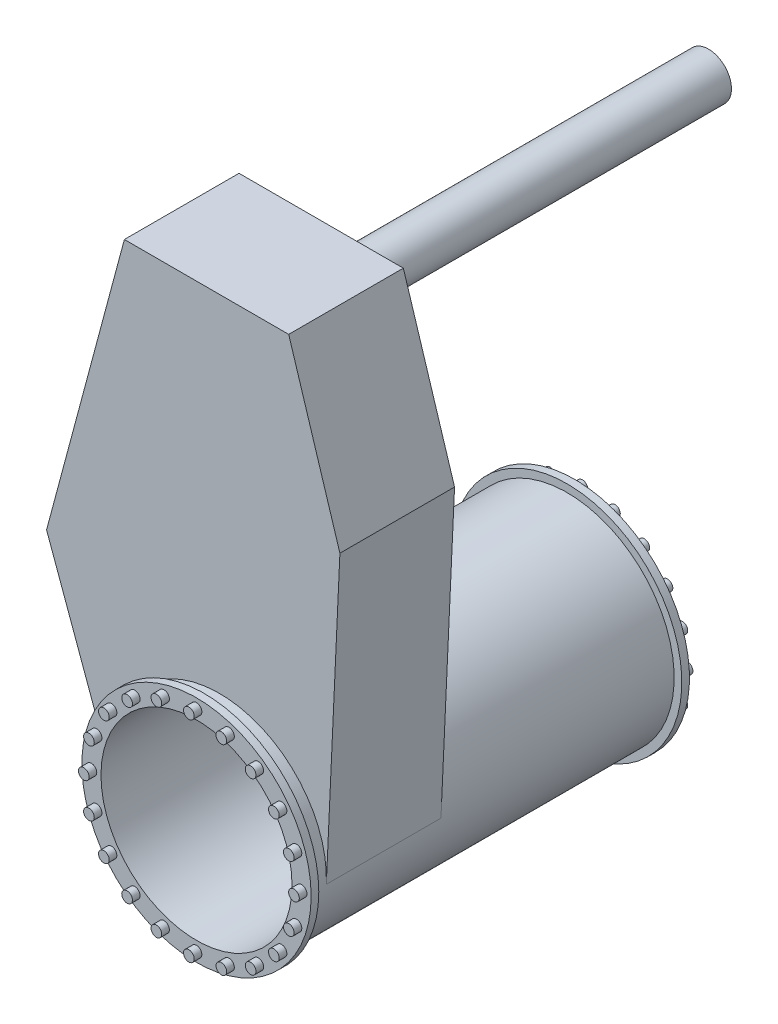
ISO-10303-21;
HEADER;
FILE_DESCRIPTION(('STEP AP214'),'2;1');
FILE_NAME('part.step','',(''),(''),'','','');
FILE_SCHEMA(('AUTOMOTIVE_DESIGN { 1 0 10303 214 1 1 1 1 }'));
ENDSEC;
DATA;
#1=APPLICATION_CONTEXT('core data for automotive mechanical design processes');
#2=APPLICATION_PROTOCOL_DEFINITION('international standard','automotive_design',2000,#1);
#3=PRODUCT_CONTEXT('',#1,'mechanical');
#4=PRODUCT('Part','Part','',(#3));
#5=PRODUCT_RELATED_PRODUCT_CATEGORY('part','',(#4));
#6=PRODUCT_DEFINITION_FORMATION('','',#4);
#7=PRODUCT_DEFINITION_CONTEXT('part definition',#1,'design');
#8=PRODUCT_DEFINITION('design','',#6,#7);
#9=PRODUCT_DEFINITION_SHAPE('','',#8);
#10=(LENGTH_UNIT() NAMED_UNIT(*) SI_UNIT(.MILLI.,.METRE.));
#11=(NAMED_UNIT(*) PLANE_ANGLE_UNIT() SI_UNIT($,.RADIAN.));
#12=(NAMED_UNIT(*) SI_UNIT($,.STERADIAN.) SOLID_ANGLE_UNIT());
#13=UNCERTAINTY_MEASURE_WITH_UNIT(LENGTH_MEASURE(1.E-05),#10,'distance_accuracy_value','');
#14=(GEOMETRIC_REPRESENTATION_CONTEXT(3) GLOBAL_UNCERTAINTY_ASSIGNED_CONTEXT((#13)) GLOBAL_UNIT_ASSIGNED_CONTEXT((#10,
#11,#12)) REPRESENTATION_CONTEXT('',''));
#15=CARTESIAN_POINT('',(0.,0.,0.));
#16=DIRECTION('',(0.,0.,1.));
#17=DIRECTION('',(1.,0.,0.));
#18=AXIS2_PLACEMENT_3D('',#15,#16,#17);
#19=CARTESIAN_POINT('',(0.,0.,10.));
#20=DIRECTION('',(0.,0.,1.));
#21=DIRECTION('',(1.,0.,0.));
#22=AXIS2_PLACEMENT_3D('',#19,#20,#21);
#23=PLANE('',#22);
#24=CARTESIAN_POINT('',(42.4898367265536,130.770270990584,10.));
#25=DIRECTION('',(0.,0.,1.));
#26=DIRECTION('',(0.951056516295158,-0.309016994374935,0.));
#27=AXIS2_PLACEMENT_3D('',#24,#25,#26);
#28=CIRCLE('',#27,7.);
#29=CARTESIAN_POINT('',(49.1472323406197,128.60715202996,10.));
#30=VERTEX_POINT('',#29);
#31=EDGE_CURVE('E148',#30,#30,#28,.T.);
#32=ORIENTED_EDGE('',*,*,#31,.F.);
#33=EDGE_LOOP('',(#32));
#34=FACE_BOUND('',#33,.T.);
#35=CARTESIAN_POINT('',(80.8204721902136,111.239836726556,10.));
#36=DIRECTION('',(0.,0.,1.));
#37=DIRECTION('',(0.809016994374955,-0.587785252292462,0.));
#38=AXIS2_PLACEMENT_3D('',#35,#36,#37);
#39=CIRCLE('',#38,7.);
#40=CARTESIAN_POINT('',(86.4835911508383,107.125339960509,10.));
#41=VERTEX_POINT('',#40);
#42=EDGE_CURVE('E155',#41,#41,#39,.T.);
#43=ORIENTED_EDGE('',*,*,#42,.F.);
#44=EDGE_LOOP('',(#43));
#45=FACE_BOUND('',#44,.T.);
#46=CARTESIAN_POINT('',(111.239836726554,80.8204721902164,10.));
#47=DIRECTION('',(0.,0.,1.));
#48=DIRECTION('',(0.587785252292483,-0.80901699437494,0.));
#49=AXIS2_PLACEMENT_3D('',#46,#47,#48);
#50=CIRCLE('',#49,7.);
#51=CARTESIAN_POINT('',(115.354333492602,75.1573532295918,10.));
#52=VERTEX_POINT('',#51);
#53=EDGE_CURVE('E161',#52,#52,#50,.T.);
#54=ORIENTED_EDGE('',*,*,#53,.F.);
#55=EDGE_LOOP('',(#54));
#56=FACE_BOUND('',#55,.T.);
#57=CARTESIAN_POINT('',(130.770270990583,42.4898367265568,10.));
#58=DIRECTION('',(0.,0.,1.));
#59=DIRECTION('',(0.309016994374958,-0.95105651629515,0.));
#60=AXIS2_PLACEMENT_3D('',#57,#58,#59);
#61=CIRCLE('',#60,7.);
#62=CARTESIAN_POINT('',(132.933389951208,35.8324411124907,10.));
#63=VERTEX_POINT('',#62);
#64=EDGE_CURVE('E167',#63,#63,#61,.T.);
#65=ORIENTED_EDGE('',*,*,#64,.F.);
#66=EDGE_LOOP('',(#65));
#67=FACE_BOUND('',#66,.T.);
#68=CARTESIAN_POINT('',(137.5,1.44023605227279E-12,10.));
#69=DIRECTION('',(0.,0.,1.));
#70=DIRECTION('',(0.,-1.,0.));
#71=AXIS2_PLACEMENT_3D('',#68,#69,#70);
#72=CIRCLE('',#71,7.);
#73=CARTESIAN_POINT('',(137.5,-6.99999999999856,10.));
#74=VERTEX_POINT('',#73);
#75=EDGE_CURVE('E173',#74,#74,#72,.T.);
#76=ORIENTED_EDGE('',*,*,#75,.F.);
#77=EDGE_LOOP('',(#76));
#78=FACE_BOUND('',#77,.T.);
#79=CARTESIAN_POINT('',(130.770270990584,-42.489836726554,10.));
#80=DIRECTION('',(0.,0.,1.));
#81=DIRECTION('',(-0.309016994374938,-0.951056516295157,0.));
#82=AXIS2_PLACEMENT_3D('',#79,#80,#81);
#83=CIRCLE('',#82,7.);
#84=CARTESIAN_POINT('',(128.607152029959,-49.1472323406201,10.));
#85=VERTEX_POINT('',#84);
#86=EDGE_CURVE('E179',#85,#85,#83,.T.);
#87=ORIENTED_EDGE('',*,*,#86,.F.);
#88=EDGE_LOOP('',(#87));
#89=FACE_BOUND('',#88,.T.);
#90=CARTESIAN_POINT('',(111.239836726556,-80.820472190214,10.));
#91=DIRECTION('',(0.,0.,1.));
#92=DIRECTION('',(-0.587785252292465,-0.809016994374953,0.));
#93=AXIS2_PLACEMENT_3D('',#90,#91,#92);
#94=CIRCLE('',#93,7.);
#95=CARTESIAN_POINT('',(107.125339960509,-86.4835911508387,10.));
#96=VERTEX_POINT('',#95);
#97=EDGE_CURVE('E185',#96,#96,#94,.T.);
#98=ORIENTED_EDGE('',*,*,#97,.F.);
#99=EDGE_LOOP('',(#98));
#100=FACE_BOUND('',#99,.T.);
#101=CARTESIAN_POINT('',(80.820472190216,-111.239836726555,10.));
#102=DIRECTION('',(0.,0.,1.));
#103=DIRECTION('',(-0.809016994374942,-0.58778525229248,0.));
#104=AXIS2_PLACEMENT_3D('',#101,#102,#103);
#105=CIRCLE('',#104,7.);
#106=CARTESIAN_POINT('',(75.1573532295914,-115.354333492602,10.));
#107=VERTEX_POINT('',#106);
#108=EDGE_CURVE('E191',#107,#107,#105,.T.);
#109=ORIENTED_EDGE('',*,*,#108,.F.);
#110=EDGE_LOOP('',(#109));
#111=FACE_BOUND('',#110,.T.);
#112=CARTESIAN_POINT('',(42.4898367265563,-130.770270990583,10.));
#113=DIRECTION('',(0.,0.,1.));
#114=DIRECTION('',(-0.951056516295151,-0.309016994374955,0.));
#115=AXIS2_PLACEMENT_3D('',#112,#113,#114);
#116=CIRCLE('',#115,7.);
#117=CARTESIAN_POINT('',(35.8324411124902,-132.933389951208,10.));
#118=VERTEX_POINT('',#117);
#119=EDGE_CURVE('E197',#118,#118,#116,.T.);
#120=ORIENTED_EDGE('',*,*,#119,.F.);
#121=EDGE_LOOP('',(#120));
#122=FACE_BOUND('',#121,.T.);
#123=CARTESIAN_POINT('',(0.,-137.5,10.));
#124=DIRECTION('',(0.,0.,1.));
#125=DIRECTION('',(-1.,0.,0.));
#126=AXIS2_PLACEMENT_3D('',#123,#124,#125);
#127=CIRCLE('',#126,7.);
#128=CARTESIAN_POINT('',(-7.,-137.5,10.));
#129=VERTEX_POINT('',#128);
#130=EDGE_CURVE('E203',#129,#129,#127,.T.);
#131=ORIENTED_EDGE('',*,*,#130,.F.);
#132=EDGE_LOOP('',(#131));
#133=FACE_BOUND('',#132,.T.);
#134=CARTESIAN_POINT('',(-42.4898367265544,-130.770270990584,10.));
#135=DIRECTION('',(0.,0.,1.));
#136=DIRECTION('',(-0.951056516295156,0.309016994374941,0.));
#137=AXIS2_PLACEMENT_3D('',#134,#135,#136);
#138=CIRCLE('',#137,7.);
#139=CARTESIAN_POINT('',(-49.1472323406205,-128.607152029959,10.));
#140=VERTEX_POINT('',#139);
#141=EDGE_CURVE('E209',#140,#140,#138,.T.);
#142=ORIENTED_EDGE('',*,*,#141,.F.);
#143=EDGE_LOOP('',(#142));
#144=FACE_BOUND('',#143,.T.);
#145=CARTESIAN_POINT('',(-80.8204721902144,-111.239836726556,10.));
#146=DIRECTION('',(0.,0.,1.));
#147=DIRECTION('',(-0.809016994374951,0.587785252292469,0.));
#148=AXIS2_PLACEMENT_3D('',#145,#146,#147);
#149=CIRCLE('',#148,7.);
#150=CARTESIAN_POINT('',(-86.4835911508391,-107.125339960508,10.));
#151=VERTEX_POINT('',#150);
#152=EDGE_CURVE('E215',#151,#151,#149,.T.);
#153=ORIENTED_EDGE('',*,*,#152,.F.);
#154=EDGE_LOOP('',(#153));
#155=FACE_BOUND('',#154,.T.);
#156=CARTESIAN_POINT('',(-111.239836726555,-80.8204721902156,10.));
#157=DIRECTION('',(0.,0.,1.));
#158=DIRECTION('',(-0.587785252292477,0.809016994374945,0.));
#159=AXIS2_PLACEMENT_3D('',#156,#157,#158);
#160=CIRCLE('',#159,7.);
#161=CARTESIAN_POINT('',(-115.354333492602,-75.157353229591,10.));
#162=VERTEX_POINT('',#161);
#163=EDGE_CURVE('E221',#162,#162,#160,.T.);
#164=ORIENTED_EDGE('',*,*,#163,.F.);
#165=EDGE_LOOP('',(#164));
#166=FACE_BOUND('',#165,.T.);
#167=CARTESIAN_POINT('',(-130.770270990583,-42.4898367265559,10.));
#168=DIRECTION('',(0.,0.,1.));
#169=DIRECTION('',(-0.309016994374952,0.951056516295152,0.));
#170=AXIS2_PLACEMENT_3D('',#167,#168,#169);
#171=CIRCLE('',#170,7.);
#172=CARTESIAN_POINT('',(-132.933389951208,-35.8324411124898,10.));
#173=VERTEX_POINT('',#172);
#174=EDGE_CURVE('E227',#173,#173,#171,.T.);
#175=ORIENTED_EDGE('',*,*,#174,.F.);
#176=EDGE_LOOP('',(#175));
#177=FACE_BOUND('',#176,.T.);
#178=CARTESIAN_POINT('',(-137.5,-4.80078684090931E-13,10.));
#179=DIRECTION('',(0.,0.,1.));
#180=DIRECTION('',(0.,1.,0.));
#181=AXIS2_PLACEMENT_3D('',#178,#179,#180);
#182=CIRCLE('',#181,7.);
#183=CARTESIAN_POINT('',(-137.5,6.99999999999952,10.));
#184=VERTEX_POINT('',#183);
#185=EDGE_CURVE('E233',#184,#184,#182,.T.);
#186=ORIENTED_EDGE('',*,*,#185,.F.);
#187=EDGE_LOOP('',(#186));
#188=FACE_BOUND('',#187,.T.);
#189=CARTESIAN_POINT('',(-130.770270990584,42.4898367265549,10.));
#190=DIRECTION('',(0.,0.,1.));
#191=DIRECTION('',(0.309016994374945,0.951056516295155,0.));
#192=AXIS2_PLACEMENT_3D('',#189,#190,#191);
#193=CIRCLE('',#192,7.);
#194=CARTESIAN_POINT('',(-128.607152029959,49.147232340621,10.));
#195=VERTEX_POINT('',#194);
#196=EDGE_CURVE('E239',#195,#195,#193,.T.);
#197=ORIENTED_EDGE('',*,*,#196,.F.);
#198=EDGE_LOOP('',(#197));
#199=FACE_BOUND('',#198,.T.);
#200=CARTESIAN_POINT('',(-111.239836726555,80.8204721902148,10.));
#201=DIRECTION('',(0.,0.,1.));
#202=DIRECTION('',(0.587785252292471,0.809016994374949,0.));
#203=AXIS2_PLACEMENT_3D('',#200,#201,#202);
#204=CIRCLE('',#203,7.);
#205=CARTESIAN_POINT('',(-107.125339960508,86.4835911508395,10.));
#206=VERTEX_POINT('',#205);
#207=EDGE_CURVE('E245',#206,#206,#204,.T.);
#208=ORIENTED_EDGE('',*,*,#207,.F.);
#209=EDGE_LOOP('',(#208));
#210=FACE_BOUND('',#209,.T.);
#211=CARTESIAN_POINT('',(-80.8204721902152,111.239836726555,10.));
#212=DIRECTION('',(0.,0.,1.));
#213=DIRECTION('',(0.809016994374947,0.587785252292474,0.));
#214=AXIS2_PLACEMENT_3D('',#211,#212,#213);
#215=CIRCLE('',#214,7.);
#216=CARTESIAN_POINT('',(-75.1573532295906,115.354333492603,10.));
#217=VERTEX_POINT('',#216);
#218=EDGE_CURVE('E251',#217,#217,#215,.T.);
#219=ORIENTED_EDGE('',*,*,#218,.F.);
#220=EDGE_LOOP('',(#219));
#221=FACE_BOUND('',#220,.T.);
#222=CARTESIAN_POINT('',(-42.4898367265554,130.770270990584,10.));
#223=DIRECTION('',(0.,0.,1.));
#224=DIRECTION('',(0.951056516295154,0.309016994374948,0.));
#225=AXIS2_PLACEMENT_3D('',#222,#223,#224);
#226=CIRCLE('',#225,7.);
#227=CARTESIAN_POINT('',(-35.8324411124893,132.933389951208,10.));
#228=VERTEX_POINT('',#227);
#229=EDGE_CURVE('E257',#228,#228,#226,.T.);
#230=ORIENTED_EDGE('',*,*,#229,.F.);
#231=EDGE_LOOP('',(#230));
#232=FACE_BOUND('',#231,.T.);
#233=CARTESIAN_POINT('',(0.,137.5,10.));
#234=DIRECTION('',(0.,0.,1.));
#235=DIRECTION('',(1.,0.,0.));
#236=AXIS2_PLACEMENT_3D('',#233,#234,#235);
#237=CIRCLE('',#236,7.);
#238=CARTESIAN_POINT('',(7.,137.5,10.));
#239=VERTEX_POINT('',#238);
#240=EDGE_CURVE('E263',#239,#239,#237,.T.);
#241=ORIENTED_EDGE('',*,*,#240,.F.);
#242=EDGE_LOOP('',(#241));
#243=FACE_BOUND('',#242,.T.);
#244=CARTESIAN_POINT('',(0.,0.,10.));
#245=DIRECTION('',(0.,0.,1.));
#246=DIRECTION('',(1.,0.,0.));
#247=AXIS2_PLACEMENT_3D('',#244,#245,#246);
#248=CIRCLE('',#247,150.);
#249=CARTESIAN_POINT('',(150.,0.,10.));
#250=VERTEX_POINT('',#249);
#251=EDGE_CURVE('E151',#250,#250,#248,.T.);
#252=ORIENTED_EDGE('',*,*,#251,.T.);
#253=EDGE_LOOP('',(#252));
#254=FACE_BOUND('',#253,.T.);
#255=CARTESIAN_POINT('',(0.,0.,10.));
#256=DIRECTION('',(0.,0.,1.));
#257=DIRECTION('',(1.,0.,0.));
#258=AXIS2_PLACEMENT_3D('',#255,#256,#257);
#259=CIRCLE('',#258,125.);
#260=CARTESIAN_POINT('',(125.,0.,10.));
#261=VERTEX_POINT('',#260);
#262=EDGE_CURVE('E269',#261,#261,#259,.T.);
#263=ORIENTED_EDGE('',*,*,#262,.F.);
#264=EDGE_LOOP('',(#263));
#265=FACE_BOUND('',#264,.T.);
#266=ADVANCED_FACE('F40',(#34,#45,#56,#67,#78,#89,#100,#111,#122,#133,#144,#155,#166,#177,#188,
#199,#210,#221,#232,#243,#254,#265),#23,.T.);
#267=CARTESIAN_POINT('',(0.,0.,0.));
#268=DIRECTION('',(0.,0.,1.));
#269=DIRECTION('',(1.,0.,0.));
#270=AXIS2_PLACEMENT_3D('',#267,#268,#269);
#271=PLANE('',#270);
#272=CARTESIAN_POINT('',(0.,0.,0.));
#273=DIRECTION('',(0.,0.,-1.));
#274=DIRECTION('',(-1.,0.,0.));
#275=AXIS2_PLACEMENT_3D('',#272,#273,#274);
#276=CIRCLE('',#275,140.);
#277=CARTESIAN_POINT('',(-140.,0.,0.));
#278=VERTEX_POINT('',#277);
#279=EDGE_CURVE('E49',#278,#278,#276,.T.);
#280=ORIENTED_EDGE('',*,*,#279,.F.);
#281=EDGE_LOOP('',(#280));
#282=FACE_BOUND('',#281,.T.);
#283=CARTESIAN_POINT('',(0.,0.,0.));
#284=DIRECTION('',(0.,0.,1.));
#285=DIRECTION('',(1.,0.,0.));
#286=AXIS2_PLACEMENT_3D('',#283,#284,#285);
#287=CIRCLE('',#286,150.);
#288=CARTESIAN_POINT('',(150.,0.,0.));
#289=VERTEX_POINT('',#288);
#290=EDGE_CURVE('E44',#289,#289,#287,.T.);
#291=ORIENTED_EDGE('',*,*,#290,.F.);
#292=EDGE_LOOP('',(#291));
#293=FACE_BOUND('',#292,.T.);
#294=ADVANCED_FACE('F280',(#282,#293),#271,.F.);
#295=CARTESIAN_POINT('',(0.,0.,10.));
#296=DIRECTION('',(0.,0.,-1.));
#297=DIRECTION('',(-1.,0.,0.));
#298=AXIS2_PLACEMENT_3D('',#295,#296,#297);
#299=CYLINDRICAL_SURFACE('',#298,150.);
#300=ORIENTED_EDGE('',*,*,#251,.F.);
#301=EDGE_LOOP('',(#300));
#302=FACE_BOUND('',#301,.T.);
#303=ORIENTED_EDGE('',*,*,#290,.T.);
#304=EDGE_LOOP('',(#303));
#305=FACE_BOUND('',#304,.T.);
#306=ADVANCED_FACE('F42',(#302,#305),#299,.T.);
#307=CARTESIAN_POINT('',(0.,0.,10.));
#308=DIRECTION('',(0.,0.,-1.));
#309=DIRECTION('',(-1.,0.,0.));
#310=AXIS2_PLACEMENT_3D('',#307,#308,#309);
#311=CYLINDRICAL_SURFACE('',#310,125.);
#312=ORIENTED_EDGE('',*,*,#262,.T.);
#313=EDGE_LOOP('',(#312));
#314=FACE_BOUND('',#313,.T.);
#315=CARTESIAN_POINT('',(0.,0.,-485.));
#316=DIRECTION('',(0.,0.,-1.));
#317=DIRECTION('',(-1.,0.,0.));
#318=AXIS2_PLACEMENT_3D('',#315,#316,#317);
#319=CIRCLE('',#318,125.);
#320=CARTESIAN_POINT('',(-125.,0.,-485.));
#321=VERTEX_POINT('',#320);
#322=EDGE_CURVE('E789',#321,#321,#319,.T.);
#323=ORIENTED_EDGE('',*,*,#322,.T.);
#324=EDGE_LOOP('',(#323));
#325=FACE_BOUND('',#324,.T.);
#326=ADVANCED_FACE('F287',(#314,#325),#311,.F.);
#327=CARTESIAN_POINT('',(0.,137.5,20.));
#328=DIRECTION('',(0.,0.,-1.));
#329=DIRECTION('',(-1.,0.,0.));
#330=AXIS2_PLACEMENT_3D('',#327,#328,#329);
#331=CYLINDRICAL_SURFACE('',#330,7.);
#332=CARTESIAN_POINT('',(0.,137.5,20.));
#333=DIRECTION('',(0.,0.,1.));
#334=DIRECTION('',(1.,0.,0.));
#335=AXIS2_PLACEMENT_3D('',#332,#333,#334);
#336=CIRCLE('',#335,7.);
#337=CARTESIAN_POINT('',(7.,137.5,20.));
#338=VERTEX_POINT('',#337);
#339=EDGE_CURVE('E266',#338,#338,#336,.T.);
#340=ORIENTED_EDGE('',*,*,#339,.F.);
#341=EDGE_LOOP('',(#340));
#342=FACE_BOUND('',#341,.T.);
#343=ORIENTED_EDGE('',*,*,#240,.T.);
#344=EDGE_LOOP('',(#343));
#345=FACE_BOUND('',#344,.T.);
#346=ADVANCED_FACE('F295',(#342,#345),#331,.T.);
#347=CARTESIAN_POINT('',(0.,0.,20.));
#348=DIRECTION('',(0.,0.,1.));
#349=DIRECTION('',(1.,0.,0.));
#350=AXIS2_PLACEMENT_3D('',#347,#348,#349);
#351=PLANE('',#350);
#352=ORIENTED_EDGE('',*,*,#339,.T.);
#353=EDGE_LOOP('',(#352));
#354=FACE_BOUND('',#353,.T.);
#355=ADVANCED_FACE('F299',(#354),#351,.T.);
#356=CARTESIAN_POINT('',(-42.4898367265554,130.770270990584,20.));
#357=DIRECTION('',(0.,0.,-1.));
#358=DIRECTION('',(-1.,0.,0.));
#359=AXIS2_PLACEMENT_3D('',#356,#357,#358);
#360=CYLINDRICAL_SURFACE('',#359,7.);
#361=CARTESIAN_POINT('',(-42.4898367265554,130.770270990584,20.));
#362=DIRECTION('',(0.,0.,1.));
#363=DIRECTION('',(0.951056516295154,0.309016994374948,0.));
#364=AXIS2_PLACEMENT_3D('',#361,#362,#363);
#365=CIRCLE('',#364,7.);
#366=CARTESIAN_POINT('',(-35.8324411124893,132.933389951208,20.));
#367=VERTEX_POINT('',#366);
#368=EDGE_CURVE('E260',#367,#367,#365,.T.);
#369=ORIENTED_EDGE('',*,*,#368,.F.);
#370=EDGE_LOOP('',(#369));
#371=FACE_BOUND('',#370,.T.);
#372=ORIENTED_EDGE('',*,*,#229,.T.);
#373=EDGE_LOOP('',(#372));
#374=FACE_BOUND('',#373,.T.);
#375=ADVANCED_FACE('F303',(#371,#374),#360,.T.);
#376=CARTESIAN_POINT('',(0.,0.,20.));
#377=DIRECTION('',(0.,0.,1.));
#378=DIRECTION('',(0.951056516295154,0.309016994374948,0.));
#379=AXIS2_PLACEMENT_3D('',#376,#377,#378);
#380=PLANE('',#379);
#381=ORIENTED_EDGE('',*,*,#368,.T.);
#382=EDGE_LOOP('',(#381));
#383=FACE_BOUND('',#382,.T.);
#384=ADVANCED_FACE('F307',(#383),#380,.T.);
#385=CARTESIAN_POINT('',(-80.8204721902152,111.239836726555,20.));
#386=DIRECTION('',(0.,0.,-1.));
#387=DIRECTION('',(-1.,0.,0.));
#388=AXIS2_PLACEMENT_3D('',#385,#386,#387);
#389=CYLINDRICAL_SURFACE('',#388,7.);
#390=CARTESIAN_POINT('',(-80.8204721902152,111.239836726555,20.));
#391=DIRECTION('',(0.,0.,1.));
#392=DIRECTION('',(0.809016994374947,0.587785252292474,0.));
#393=AXIS2_PLACEMENT_3D('',#390,#391,#392);
#394=CIRCLE('',#393,7.);
#395=CARTESIAN_POINT('',(-75.1573532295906,115.354333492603,20.));
#396=VERTEX_POINT('',#395);
#397=EDGE_CURVE('E254',#396,#396,#394,.T.);
#398=ORIENTED_EDGE('',*,*,#397,.F.);
#399=EDGE_LOOP('',(#398));
#400=FACE_BOUND('',#399,.T.);
#401=ORIENTED_EDGE('',*,*,#218,.T.);
#402=EDGE_LOOP('',(#401));
#403=FACE_BOUND('',#402,.T.);
#404=ADVANCED_FACE('F311',(#400,#403),#389,.T.);
#405=CARTESIAN_POINT('',(0.,0.,20.));
#406=DIRECTION('',(0.,0.,1.));
#407=DIRECTION('',(0.809016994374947,0.587785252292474,0.));
#408=AXIS2_PLACEMENT_3D('',#405,#406,#407);
#409=PLANE('',#408);
#410=ORIENTED_EDGE('',*,*,#397,.T.);
#411=EDGE_LOOP('',(#410));
#412=FACE_BOUND('',#411,.T.);
#413=ADVANCED_FACE('F315',(#412),#409,.T.);
#414=CARTESIAN_POINT('',(-111.239836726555,80.8204721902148,20.));
#415=DIRECTION('',(0.,0.,-1.));
#416=DIRECTION('',(-1.,0.,0.));
#417=AXIS2_PLACEMENT_3D('',#414,#415,#416);
#418=CYLINDRICAL_SURFACE('',#417,7.);
#419=CARTESIAN_POINT('',(-111.239836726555,80.8204721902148,20.));
#420=DIRECTION('',(0.,0.,1.));
#421=DIRECTION('',(0.587785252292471,0.809016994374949,0.));
#422=AXIS2_PLACEMENT_3D('',#419,#420,#421);
#423=CIRCLE('',#422,7.);
#424=CARTESIAN_POINT('',(-107.125339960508,86.4835911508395,20.));
#425=VERTEX_POINT('',#424);
#426=EDGE_CURVE('E248',#425,#425,#423,.T.);
#427=ORIENTED_EDGE('',*,*,#426,.F.);
#428=EDGE_LOOP('',(#427));
#429=FACE_BOUND('',#428,.T.);
#430=ORIENTED_EDGE('',*,*,#207,.T.);
#431=EDGE_LOOP('',(#430));
#432=FACE_BOUND('',#431,.T.);
#433=ADVANCED_FACE('F319',(#429,#432),#418,.T.);
#434=CARTESIAN_POINT('',(0.,0.,20.));
#435=DIRECTION('',(0.,0.,1.));
#436=DIRECTION('',(0.587785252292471,0.809016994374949,0.));
#437=AXIS2_PLACEMENT_3D('',#434,#435,#436);
#438=PLANE('',#437);
#439=ORIENTED_EDGE('',*,*,#426,.T.);
#440=EDGE_LOOP('',(#439));
#441=FACE_BOUND('',#440,.T.);
#442=ADVANCED_FACE('F323',(#441),#438,.T.);
#443=CARTESIAN_POINT('',(-130.770270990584,42.4898367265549,20.));
#444=DIRECTION('',(0.,0.,-1.));
#445=DIRECTION('',(-1.,0.,0.));
#446=AXIS2_PLACEMENT_3D('',#443,#444,#445);
#447=CYLINDRICAL_SURFACE('',#446,7.);
#448=CARTESIAN_POINT('',(-130.770270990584,42.4898367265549,20.));
#449=DIRECTION('',(0.,0.,1.));
#450=DIRECTION('',(0.309016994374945,0.951056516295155,0.));
#451=AXIS2_PLACEMENT_3D('',#448,#449,#450);
#452=CIRCLE('',#451,7.);
#453=CARTESIAN_POINT('',(-128.607152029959,49.147232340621,20.));
#454=VERTEX_POINT('',#453);
#455=EDGE_CURVE('E242',#454,#454,#452,.T.);
#456=ORIENTED_EDGE('',*,*,#455,.F.);
#457=EDGE_LOOP('',(#456));
#458=FACE_BOUND('',#457,.T.);
#459=ORIENTED_EDGE('',*,*,#196,.T.);
#460=EDGE_LOOP('',(#459));
#461=FACE_BOUND('',#460,.T.);
#462=ADVANCED_FACE('F327',(#458,#461),#447,.T.);
#463=CARTESIAN_POINT('',(0.,0.,20.));
#464=DIRECTION('',(0.,0.,1.));
#465=DIRECTION('',(0.309016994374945,0.951056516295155,0.));
#466=AXIS2_PLACEMENT_3D('',#463,#464,#465);
#467=PLANE('',#466);
#468=ORIENTED_EDGE('',*,*,#455,.T.);
#469=EDGE_LOOP('',(#468));
#470=FACE_BOUND('',#469,.T.);
#471=ADVANCED_FACE('F331',(#470),#467,.T.);
#472=CARTESIAN_POINT('',(-137.5,-4.80078684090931E-13,20.));
#473=DIRECTION('',(0.,0.,-1.));
#474=DIRECTION('',(-1.,0.,0.));
#475=AXIS2_PLACEMENT_3D('',#472,#473,#474);
#476=CYLINDRICAL_SURFACE('',#475,7.);
#477=CARTESIAN_POINT('',(-137.5,-4.80078684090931E-13,20.));
#478=DIRECTION('',(0.,0.,1.));
#479=DIRECTION('',(0.,1.,0.));
#480=AXIS2_PLACEMENT_3D('',#477,#478,#479);
#481=CIRCLE('',#480,7.);
#482=CARTESIAN_POINT('',(-137.5,6.99999999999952,20.));
#483=VERTEX_POINT('',#482);
#484=EDGE_CURVE('E236',#483,#483,#481,.T.);
#485=ORIENTED_EDGE('',*,*,#484,.F.);
#486=EDGE_LOOP('',(#485));
#487=FACE_BOUND('',#486,.T.);
#488=ORIENTED_EDGE('',*,*,#185,.T.);
#489=EDGE_LOOP('',(#488));
#490=FACE_BOUND('',#489,.T.);
#491=ADVANCED_FACE('F335',(#487,#490),#476,.T.);
#492=CARTESIAN_POINT('',(0.,0.,20.));
#493=DIRECTION('',(0.,0.,1.));
#494=DIRECTION('',(0.,1.,0.));
#495=AXIS2_PLACEMENT_3D('',#492,#493,#494);
#496=PLANE('',#495);
#497=ORIENTED_EDGE('',*,*,#484,.T.);
#498=EDGE_LOOP('',(#497));
#499=FACE_BOUND('',#498,.T.);
#500=ADVANCED_FACE('F339',(#499),#496,.T.);
#501=CARTESIAN_POINT('',(-130.770270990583,-42.4898367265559,20.));
#502=DIRECTION('',(0.,0.,-1.));
#503=DIRECTION('',(-1.,0.,0.));
#504=AXIS2_PLACEMENT_3D('',#501,#502,#503);
#505=CYLINDRICAL_SURFACE('',#504,7.);
#506=CARTESIAN_POINT('',(-130.770270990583,-42.4898367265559,20.));
#507=DIRECTION('',(0.,0.,1.));
#508=DIRECTION('',(-0.309016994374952,0.951056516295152,0.));
#509=AXIS2_PLACEMENT_3D('',#506,#507,#508);
#510=CIRCLE('',#509,7.);
#511=CARTESIAN_POINT('',(-132.933389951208,-35.8324411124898,20.));
#512=VERTEX_POINT('',#511);
#513=EDGE_CURVE('E230',#512,#512,#510,.T.);
#514=ORIENTED_EDGE('',*,*,#513,.F.);
#515=EDGE_LOOP('',(#514));
#516=FACE_BOUND('',#515,.T.);
#517=ORIENTED_EDGE('',*,*,#174,.T.);
#518=EDGE_LOOP('',(#517));
#519=FACE_BOUND('',#518,.T.);
#520=ADVANCED_FACE('F343',(#516,#519),#505,.T.);
#521=CARTESIAN_POINT('',(0.,0.,20.));
#522=DIRECTION('',(0.,0.,1.));
#523=DIRECTION('',(-0.309016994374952,0.951056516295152,0.));
#524=AXIS2_PLACEMENT_3D('',#521,#522,#523);
#525=PLANE('',#524);
#526=ORIENTED_EDGE('',*,*,#513,.T.);
#527=EDGE_LOOP('',(#526));
#528=FACE_BOUND('',#527,.T.);
#529=ADVANCED_FACE('F347',(#528),#525,.T.);
#530=CARTESIAN_POINT('',(-111.239836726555,-80.8204721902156,20.));
#531=DIRECTION('',(0.,0.,-1.));
#532=DIRECTION('',(-1.,0.,0.));
#533=AXIS2_PLACEMENT_3D('',#530,#531,#532);
#534=CYLINDRICAL_SURFACE('',#533,7.);
#535=CARTESIAN_POINT('',(-111.239836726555,-80.8204721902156,20.));
#536=DIRECTION('',(0.,0.,1.));
#537=DIRECTION('',(-0.587785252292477,0.809016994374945,0.));
#538=AXIS2_PLACEMENT_3D('',#535,#536,#537);
#539=CIRCLE('',#538,7.);
#540=CARTESIAN_POINT('',(-115.354333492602,-75.157353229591,20.));
#541=VERTEX_POINT('',#540);
#542=EDGE_CURVE('E224',#541,#541,#539,.T.);
#543=ORIENTED_EDGE('',*,*,#542,.F.);
#544=EDGE_LOOP('',(#543));
#545=FACE_BOUND('',#544,.T.);
#546=ORIENTED_EDGE('',*,*,#163,.T.);
#547=EDGE_LOOP('',(#546));
#548=FACE_BOUND('',#547,.T.);
#549=ADVANCED_FACE('F351',(#545,#548),#534,.T.);
#550=CARTESIAN_POINT('',(0.,0.,20.));
#551=DIRECTION('',(0.,0.,1.));
#552=DIRECTION('',(-0.587785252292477,0.809016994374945,0.));
#553=AXIS2_PLACEMENT_3D('',#550,#551,#552);
#554=PLANE('',#553);
#555=ORIENTED_EDGE('',*,*,#542,.T.);
#556=EDGE_LOOP('',(#555));
#557=FACE_BOUND('',#556,.T.);
#558=ADVANCED_FACE('F355',(#557),#554,.T.);
#559=CARTESIAN_POINT('',(-80.8204721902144,-111.239836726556,20.));
#560=DIRECTION('',(0.,0.,-1.));
#561=DIRECTION('',(-1.,0.,0.));
#562=AXIS2_PLACEMENT_3D('',#559,#560,#561);
#563=CYLINDRICAL_SURFACE('',#562,7.);
#564=CARTESIAN_POINT('',(-80.8204721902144,-111.239836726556,20.));
#565=DIRECTION('',(0.,0.,1.));
#566=DIRECTION('',(-0.809016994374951,0.587785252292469,0.));
#567=AXIS2_PLACEMENT_3D('',#564,#565,#566);
#568=CIRCLE('',#567,7.);
#569=CARTESIAN_POINT('',(-86.4835911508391,-107.125339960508,20.));
#570=VERTEX_POINT('',#569);
#571=EDGE_CURVE('E218',#570,#570,#568,.T.);
#572=ORIENTED_EDGE('',*,*,#571,.F.);
#573=EDGE_LOOP('',(#572));
#574=FACE_BOUND('',#573,.T.);
#575=ORIENTED_EDGE('',*,*,#152,.T.);
#576=EDGE_LOOP('',(#575));
#577=FACE_BOUND('',#576,.T.);
#578=ADVANCED_FACE('F359',(#574,#577),#563,.T.);
#579=CARTESIAN_POINT('',(0.,0.,20.));
#580=DIRECTION('',(0.,0.,1.));
#581=DIRECTION('',(-0.809016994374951,0.587785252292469,0.));
#582=AXIS2_PLACEMENT_3D('',#579,#580,#581);
#583=PLANE('',#582);
#584=ORIENTED_EDGE('',*,*,#571,.T.);
#585=EDGE_LOOP('',(#584));
#586=FACE_BOUND('',#585,.T.);
#587=ADVANCED_FACE('F363',(#586),#583,.T.);
#588=CARTESIAN_POINT('',(-42.4898367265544,-130.770270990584,20.));
#589=DIRECTION('',(0.,0.,-1.));
#590=DIRECTION('',(-1.,0.,0.));
#591=AXIS2_PLACEMENT_3D('',#588,#589,#590);
#592=CYLINDRICAL_SURFACE('',#591,7.);
#593=CARTESIAN_POINT('',(-42.4898367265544,-130.770270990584,20.));
#594=DIRECTION('',(0.,0.,1.));
#595=DIRECTION('',(-0.951056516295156,0.309016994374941,0.));
#596=AXIS2_PLACEMENT_3D('',#593,#594,#595);
#597=CIRCLE('',#596,7.);
#598=CARTESIAN_POINT('',(-49.1472323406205,-128.607152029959,20.));
#599=VERTEX_POINT('',#598);
#600=EDGE_CURVE('E212',#599,#599,#597,.T.);
#601=ORIENTED_EDGE('',*,*,#600,.F.);
#602=EDGE_LOOP('',(#601));
#603=FACE_BOUND('',#602,.T.);
#604=ORIENTED_EDGE('',*,*,#141,.T.);
#605=EDGE_LOOP('',(#604));
#606=FACE_BOUND('',#605,.T.);
#607=ADVANCED_FACE('F367',(#603,#606),#592,.T.);
#608=CARTESIAN_POINT('',(0.,0.,20.));
#609=DIRECTION('',(0.,0.,1.));
#610=DIRECTION('',(-0.951056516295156,0.309016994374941,0.));
#611=AXIS2_PLACEMENT_3D('',#608,#609,#610);
#612=PLANE('',#611);
#613=ORIENTED_EDGE('',*,*,#600,.T.);
#614=EDGE_LOOP('',(#613));
#615=FACE_BOUND('',#614,.T.);
#616=ADVANCED_FACE('F371',(#615),#612,.T.);
#617=CARTESIAN_POINT('',(0.,-137.5,20.));
#618=DIRECTION('',(0.,0.,-1.));
#619=DIRECTION('',(-1.,0.,0.));
#620=AXIS2_PLACEMENT_3D('',#617,#618,#619);
#621=CYLINDRICAL_SURFACE('',#620,7.);
#622=CARTESIAN_POINT('',(0.,-137.5,20.));
#623=DIRECTION('',(0.,0.,1.));
#624=DIRECTION('',(-1.,0.,0.));
#625=AXIS2_PLACEMENT_3D('',#622,#623,#624);
#626=CIRCLE('',#625,7.);
#627=CARTESIAN_POINT('',(-7.,-137.5,20.));
#628=VERTEX_POINT('',#627);
#629=EDGE_CURVE('E206',#628,#628,#626,.T.);
#630=ORIENTED_EDGE('',*,*,#629,.F.);
#631=EDGE_LOOP('',(#630));
#632=FACE_BOUND('',#631,.T.);
#633=ORIENTED_EDGE('',*,*,#130,.T.);
#634=EDGE_LOOP('',(#633));
#635=FACE_BOUND('',#634,.T.);
#636=ADVANCED_FACE('F375',(#632,#635),#621,.T.);
#637=CARTESIAN_POINT('',(0.,0.,20.));
#638=DIRECTION('',(0.,0.,1.));
#639=DIRECTION('',(-1.,0.,0.));
#640=AXIS2_PLACEMENT_3D('',#637,#638,#639);
#641=PLANE('',#640);
#642=ORIENTED_EDGE('',*,*,#629,.T.);
#643=EDGE_LOOP('',(#642));
#644=FACE_BOUND('',#643,.T.);
#645=ADVANCED_FACE('F379',(#644),#641,.T.);
#646=CARTESIAN_POINT('',(42.4898367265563,-130.770270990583,20.));
#647=DIRECTION('',(0.,0.,-1.));
#648=DIRECTION('',(-1.,0.,0.));
#649=AXIS2_PLACEMENT_3D('',#646,#647,#648);
#650=CYLINDRICAL_SURFACE('',#649,7.);
#651=CARTESIAN_POINT('',(42.4898367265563,-130.770270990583,20.));
#652=DIRECTION('',(0.,0.,1.));
#653=DIRECTION('',(-0.951056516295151,-0.309016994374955,0.));
#654=AXIS2_PLACEMENT_3D('',#651,#652,#653);
#655=CIRCLE('',#654,7.);
#656=CARTESIAN_POINT('',(35.8324411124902,-132.933389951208,20.));
#657=VERTEX_POINT('',#656);
#658=EDGE_CURVE('E200',#657,#657,#655,.T.);
#659=ORIENTED_EDGE('',*,*,#658,.F.);
#660=EDGE_LOOP('',(#659));
#661=FACE_BOUND('',#660,.T.);
#662=ORIENTED_EDGE('',*,*,#119,.T.);
#663=EDGE_LOOP('',(#662));
#664=FACE_BOUND('',#663,.T.);
#665=ADVANCED_FACE('F383',(#661,#664),#650,.T.);
#666=CARTESIAN_POINT('',(0.,0.,20.));
#667=DIRECTION('',(0.,0.,1.));
#668=DIRECTION('',(-0.951056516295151,-0.309016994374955,0.));
#669=AXIS2_PLACEMENT_3D('',#666,#667,#668);
#670=PLANE('',#669);
#671=ORIENTED_EDGE('',*,*,#658,.T.);
#672=EDGE_LOOP('',(#671));
#673=FACE_BOUND('',#672,.T.);
#674=ADVANCED_FACE('F387',(#673),#670,.T.);
#675=CARTESIAN_POINT('',(80.820472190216,-111.239836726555,20.));
#676=DIRECTION('',(0.,0.,-1.));
#677=DIRECTION('',(-1.,0.,0.));
#678=AXIS2_PLACEMENT_3D('',#675,#676,#677);
#679=CYLINDRICAL_SURFACE('',#678,7.);
#680=CARTESIAN_POINT('',(80.820472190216,-111.239836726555,20.));
#681=DIRECTION('',(0.,0.,1.));
#682=DIRECTION('',(-0.809016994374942,-0.58778525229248,0.));
#683=AXIS2_PLACEMENT_3D('',#680,#681,#682);
#684=CIRCLE('',#683,7.);
#685=CARTESIAN_POINT('',(75.1573532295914,-115.354333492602,20.));
#686=VERTEX_POINT('',#685);
#687=EDGE_CURVE('E194',#686,#686,#684,.T.);
#688=ORIENTED_EDGE('',*,*,#687,.F.);
#689=EDGE_LOOP('',(#688));
#690=FACE_BOUND('',#689,.T.);
#691=ORIENTED_EDGE('',*,*,#108,.T.);
#692=EDGE_LOOP('',(#691));
#693=FACE_BOUND('',#692,.T.);
#694=ADVANCED_FACE('F391',(#690,#693),#679,.T.);
#695=CARTESIAN_POINT('',(0.,0.,20.));
#696=DIRECTION('',(0.,0.,1.));
#697=DIRECTION('',(-0.809016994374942,-0.58778525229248,0.));
#698=AXIS2_PLACEMENT_3D('',#695,#696,#697);
#699=PLANE('',#698);
#700=ORIENTED_EDGE('',*,*,#687,.T.);
#701=EDGE_LOOP('',(#700));
#702=FACE_BOUND('',#701,.T.);
#703=ADVANCED_FACE('F395',(#702),#699,.T.);
#704=CARTESIAN_POINT('',(111.239836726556,-80.820472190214,20.));
#705=DIRECTION('',(0.,0.,-1.));
#706=DIRECTION('',(-1.,0.,0.));
#707=AXIS2_PLACEMENT_3D('',#704,#705,#706);
#708=CYLINDRICAL_SURFACE('',#707,7.);
#709=CARTESIAN_POINT('',(111.239836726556,-80.820472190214,20.));
#710=DIRECTION('',(0.,0.,1.));
#711=DIRECTION('',(-0.587785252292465,-0.809016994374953,0.));
#712=AXIS2_PLACEMENT_3D('',#709,#710,#711);
#713=CIRCLE('',#712,7.);
#714=CARTESIAN_POINT('',(107.125339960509,-86.4835911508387,20.));
#715=VERTEX_POINT('',#714);
#716=EDGE_CURVE('E188',#715,#715,#713,.T.);
#717=ORIENTED_EDGE('',*,*,#716,.F.);
#718=EDGE_LOOP('',(#717));
#719=FACE_BOUND('',#718,.T.);
#720=ORIENTED_EDGE('',*,*,#97,.T.);
#721=EDGE_LOOP('',(#720));
#722=FACE_BOUND('',#721,.T.);
#723=ADVANCED_FACE('F399',(#719,#722),#708,.T.);
#724=CARTESIAN_POINT('',(0.,0.,20.));
#725=DIRECTION('',(0.,0.,1.));
#726=DIRECTION('',(-0.587785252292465,-0.809016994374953,0.));
#727=AXIS2_PLACEMENT_3D('',#724,#725,#726);
#728=PLANE('',#727);
#729=ORIENTED_EDGE('',*,*,#716,.T.);
#730=EDGE_LOOP('',(#729));
#731=FACE_BOUND('',#730,.T.);
#732=ADVANCED_FACE('F403',(#731),#728,.T.);
#733=CARTESIAN_POINT('',(130.770270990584,-42.489836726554,20.));
#734=DIRECTION('',(0.,0.,-1.));
#735=DIRECTION('',(-1.,0.,0.));
#736=AXIS2_PLACEMENT_3D('',#733,#734,#735);
#737=CYLINDRICAL_SURFACE('',#736,7.);
#738=CARTESIAN_POINT('',(130.770270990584,-42.489836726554,20.));
#739=DIRECTION('',(0.,0.,1.));
#740=DIRECTION('',(-0.309016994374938,-0.951056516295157,0.));
#741=AXIS2_PLACEMENT_3D('',#738,#739,#740);
#742=CIRCLE('',#741,7.);
#743=CARTESIAN_POINT('',(128.607152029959,-49.1472323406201,20.));
#744=VERTEX_POINT('',#743);
#745=EDGE_CURVE('E182',#744,#744,#742,.T.);
#746=ORIENTED_EDGE('',*,*,#745,.F.);
#747=EDGE_LOOP('',(#746));
#748=FACE_BOUND('',#747,.T.);
#749=ORIENTED_EDGE('',*,*,#86,.T.);
#750=EDGE_LOOP('',(#749));
#751=FACE_BOUND('',#750,.T.);
#752=ADVANCED_FACE('F407',(#748,#751),#737,.T.);
#753=CARTESIAN_POINT('',(0.,0.,20.));
#754=DIRECTION('',(0.,0.,1.));
#755=DIRECTION('',(-0.309016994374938,-0.951056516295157,0.));
#756=AXIS2_PLACEMENT_3D('',#753,#754,#755);
#757=PLANE('',#756);
#758=ORIENTED_EDGE('',*,*,#745,.T.);
#759=EDGE_LOOP('',(#758));
#760=FACE_BOUND('',#759,.T.);
#761=ADVANCED_FACE('F411',(#760),#757,.T.);
#762=CARTESIAN_POINT('',(137.5,1.44023605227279E-12,20.));
#763=DIRECTION('',(0.,0.,-1.));
#764=DIRECTION('',(-1.,0.,0.));
#765=AXIS2_PLACEMENT_3D('',#762,#763,#764);
#766=CYLINDRICAL_SURFACE('',#765,7.);
#767=CARTESIAN_POINT('',(137.5,1.44023605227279E-12,20.));
#768=DIRECTION('',(0.,0.,1.));
#769=DIRECTION('',(0.,-1.,0.));
#770=AXIS2_PLACEMENT_3D('',#767,#768,#769);
#771=CIRCLE('',#770,7.);
#772=CARTESIAN_POINT('',(137.5,-6.99999999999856,20.));
#773=VERTEX_POINT('',#772);
#774=EDGE_CURVE('E176',#773,#773,#771,.T.);
#775=ORIENTED_EDGE('',*,*,#774,.F.);
#776=EDGE_LOOP('',(#775));
#777=FACE_BOUND('',#776,.T.);
#778=ORIENTED_EDGE('',*,*,#75,.T.);
#779=EDGE_LOOP('',(#778));
#780=FACE_BOUND('',#779,.T.);
#781=ADVANCED_FACE('F415',(#777,#780),#766,.T.);
#782=CARTESIAN_POINT('',(0.,0.,20.));
#783=DIRECTION('',(0.,0.,1.));
#784=DIRECTION('',(0.,-1.,0.));
#785=AXIS2_PLACEMENT_3D('',#782,#783,#784);
#786=PLANE('',#785);
#787=ORIENTED_EDGE('',*,*,#774,.T.);
#788=EDGE_LOOP('',(#787));
#789=FACE_BOUND('',#788,.T.);
#790=ADVANCED_FACE('F419',(#789),#786,.T.);
#791=CARTESIAN_POINT('',(130.770270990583,42.4898367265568,20.));
#792=DIRECTION('',(0.,0.,-1.));
#793=DIRECTION('',(-1.,0.,0.));
#794=AXIS2_PLACEMENT_3D('',#791,#792,#793);
#795=CYLINDRICAL_SURFACE('',#794,7.);
#796=CARTESIAN_POINT('',(130.770270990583,42.4898367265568,20.));
#797=DIRECTION('',(0.,0.,1.));
#798=DIRECTION('',(0.309016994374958,-0.95105651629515,0.));
#799=AXIS2_PLACEMENT_3D('',#796,#797,#798);
#800=CIRCLE('',#799,7.);
#801=CARTESIAN_POINT('',(132.933389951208,35.8324411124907,20.));
#802=VERTEX_POINT('',#801);
#803=EDGE_CURVE('E170',#802,#802,#800,.T.);
#804=ORIENTED_EDGE('',*,*,#803,.F.);
#805=EDGE_LOOP('',(#804));
#806=FACE_BOUND('',#805,.T.);
#807=ORIENTED_EDGE('',*,*,#64,.T.);
#808=EDGE_LOOP('',(#807));
#809=FACE_BOUND('',#808,.T.);
#810=ADVANCED_FACE('F423',(#806,#809),#795,.T.);
#811=CARTESIAN_POINT('',(0.,0.,20.));
#812=DIRECTION('',(0.,0.,1.));
#813=DIRECTION('',(0.309016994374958,-0.95105651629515,0.));
#814=AXIS2_PLACEMENT_3D('',#811,#812,#813);
#815=PLANE('',#814);
#816=ORIENTED_EDGE('',*,*,#803,.T.);
#817=EDGE_LOOP('',(#816));
#818=FACE_BOUND('',#817,.T.);
#819=ADVANCED_FACE('F427',(#818),#815,.T.);
#820=CARTESIAN_POINT('',(111.239836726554,80.8204721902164,20.));
#821=DIRECTION('',(0.,0.,-1.));
#822=DIRECTION('',(-1.,0.,0.));
#823=AXIS2_PLACEMENT_3D('',#820,#821,#822);
#824=CYLINDRICAL_SURFACE('',#823,7.);
#825=CARTESIAN_POINT('',(111.239836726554,80.8204721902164,20.));
#826=DIRECTION('',(0.,0.,1.));
#827=DIRECTION('',(0.587785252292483,-0.80901699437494,0.));
#828=AXIS2_PLACEMENT_3D('',#825,#826,#827);
#829=CIRCLE('',#828,7.);
#830=CARTESIAN_POINT('',(115.354333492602,75.1573532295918,20.));
#831=VERTEX_POINT('',#830);
#832=EDGE_CURVE('E164',#831,#831,#829,.T.);
#833=ORIENTED_EDGE('',*,*,#832,.F.);
#834=EDGE_LOOP('',(#833));
#835=FACE_BOUND('',#834,.T.);
#836=ORIENTED_EDGE('',*,*,#53,.T.);
#837=EDGE_LOOP('',(#836));
#838=FACE_BOUND('',#837,.T.);
#839=ADVANCED_FACE('F431',(#835,#838),#824,.T.);
#840=CARTESIAN_POINT('',(0.,0.,20.));
#841=DIRECTION('',(0.,0.,1.));
#842=DIRECTION('',(0.587785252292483,-0.80901699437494,0.));
#843=AXIS2_PLACEMENT_3D('',#840,#841,#842);
#844=PLANE('',#843);
#845=ORIENTED_EDGE('',*,*,#832,.T.);
#846=EDGE_LOOP('',(#845));
#847=FACE_BOUND('',#846,.T.);
#848=ADVANCED_FACE('F435',(#847),#844,.T.);
#849=CARTESIAN_POINT('',(80.8204721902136,111.239836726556,20.));
#850=DIRECTION('',(0.,0.,-1.));
#851=DIRECTION('',(-1.,0.,0.));
#852=AXIS2_PLACEMENT_3D('',#849,#850,#851);
#853=CYLINDRICAL_SURFACE('',#852,7.);
#854=CARTESIAN_POINT('',(80.8204721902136,111.239836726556,20.));
#855=DIRECTION('',(0.,0.,1.));
#856=DIRECTION('',(0.809016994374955,-0.587785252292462,0.));
#857=AXIS2_PLACEMENT_3D('',#854,#855,#856);
#858=CIRCLE('',#857,7.);
#859=CARTESIAN_POINT('',(86.4835911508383,107.125339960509,20.));
#860=VERTEX_POINT('',#859);
#861=EDGE_CURVE('E158',#860,#860,#858,.T.);
#862=ORIENTED_EDGE('',*,*,#861,.F.);
#863=EDGE_LOOP('',(#862));
#864=FACE_BOUND('',#863,.T.);
#865=ORIENTED_EDGE('',*,*,#42,.T.);
#866=EDGE_LOOP('',(#865));
#867=FACE_BOUND('',#866,.T.);
#868=ADVANCED_FACE('F439',(#864,#867),#853,.T.);
#869=CARTESIAN_POINT('',(0.,0.,20.));
#870=DIRECTION('',(0.,0.,1.));
#871=DIRECTION('',(0.809016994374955,-0.587785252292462,0.));
#872=AXIS2_PLACEMENT_3D('',#869,#870,#871);
#873=PLANE('',#872);
#874=ORIENTED_EDGE('',*,*,#861,.T.);
#875=EDGE_LOOP('',(#874));
#876=FACE_BOUND('',#875,.T.);
#877=ADVANCED_FACE('F443',(#876),#873,.T.);
#878=CARTESIAN_POINT('',(42.4898367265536,130.770270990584,20.));
#879=DIRECTION('',(0.,0.,-1.));
#880=DIRECTION('',(-1.,0.,0.));
#881=AXIS2_PLACEMENT_3D('',#878,#879,#880);
#882=CYLINDRICAL_SURFACE('',#881,7.);
#883=CARTESIAN_POINT('',(42.4898367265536,130.770270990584,20.));
#884=DIRECTION('',(0.,0.,1.));
#885=DIRECTION('',(0.951056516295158,-0.309016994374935,0.));
#886=AXIS2_PLACEMENT_3D('',#883,#884,#885);
#887=CIRCLE('',#886,7.);
#888=CARTESIAN_POINT('',(49.1472323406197,128.60715202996,20.));
#889=VERTEX_POINT('',#888);
#890=EDGE_CURVE('E152',#889,#889,#887,.T.);
#891=ORIENTED_EDGE('',*,*,#890,.F.);
#892=EDGE_LOOP('',(#891));
#893=FACE_BOUND('',#892,.T.);
#894=ORIENTED_EDGE('',*,*,#31,.T.);
#895=EDGE_LOOP('',(#894));
#896=FACE_BOUND('',#895,.T.);
#897=ADVANCED_FACE('F447',(#893,#896),#882,.T.);
#898=CARTESIAN_POINT('',(0.,0.,20.));
#899=DIRECTION('',(0.,0.,1.));
#900=DIRECTION('',(0.951056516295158,-0.309016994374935,0.));
#901=AXIS2_PLACEMENT_3D('',#898,#899,#900);
#902=PLANE('',#901);
#903=ORIENTED_EDGE('',*,*,#890,.T.);
#904=EDGE_LOOP('',(#903));
#905=FACE_BOUND('',#904,.T.);
#906=ADVANCED_FACE('F451',(#905),#902,.T.);
#907=CARTESIAN_POINT('',(0.,0.,-20.));
#908=DIRECTION('',(0.,0.,1.));
#909=DIRECTION('',(1.,0.,0.));
#910=AXIS2_PLACEMENT_3D('',#907,#908,#909);
#911=CYLINDRICAL_SURFACE('',#910,140.);
#912=CARTESIAN_POINT('',(0.,0.,-20.));
#913=DIRECTION('',(0.,0.,-1.));
#914=DIRECTION('',(-1.,0.,0.));
#915=AXIS2_PLACEMENT_3D('',#912,#913,#914);
#916=CIRCLE('',#915,140.);
#917=CARTESIAN_POINT('',(-131.556966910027,-47.8828200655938,-20.));
#918=VERTEX_POINT('',#917);
#919=CARTESIAN_POINT('',(139.850047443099,-6.47798040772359,-20.));
#920=VERTEX_POINT('',#919);
#921=EDGE_CURVE('E57',#918,#920,#916,.T.);
#922=ORIENTED_EDGE('',*,*,#921,.F.);
#923=DIRECTION('',(0.,0.,1.));
#924=VECTOR('',#923,1.);
#925=CARTESIAN_POINT('',(-131.556966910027,-47.8828200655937,-170.));
#926=LINE('',#925,#924);
#927=CARTESIAN_POINT('',(-131.556966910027,-47.8828200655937,-170.));
#928=VERTEX_POINT('',#927);
#929=EDGE_CURVE('E144',#928,#918,#926,.T.);
#930=ORIENTED_EDGE('',*,*,#929,.F.);
#931=CARTESIAN_POINT('',(0.,0.,-170.));
#932=DIRECTION('',(0.,0.,-1.));
#933=DIRECTION('',(-1.,0.,0.));
#934=AXIS2_PLACEMENT_3D('',#931,#932,#933);
#935=CIRCLE('',#934,140.);
#936=CARTESIAN_POINT('',(139.850047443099,-6.47798040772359,-170.));
#937=VERTEX_POINT('',#936);
#938=EDGE_CURVE('E11',#928,#937,#935,.T.);
#939=ORIENTED_EDGE('',*,*,#938,.T.);
#940=DIRECTION('',(0.,0.,1.));
#941=VECTOR('',#940,1.);
#942=CARTESIAN_POINT('',(139.850047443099,-6.47798040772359,-170.));
#943=LINE('',#942,#941);
#944=EDGE_CURVE('E127',#937,#920,#943,.T.);
#945=ORIENTED_EDGE('',*,*,#944,.T.);
#946=EDGE_LOOP('',(#922,#930,#939,#945));
#947=FACE_BOUND('',#946,.T.);
#948=ORIENTED_EDGE('',*,*,#279,.T.);
#949=EDGE_LOOP('',(#948));
#950=FACE_BOUND('',#949,.T.);
#951=CARTESIAN_POINT('',(0.,0.,-475.));
#952=DIRECTION('',(0.,0.,-1.));
#953=DIRECTION('',(-1.,0.,0.));
#954=AXIS2_PLACEMENT_3D('',#951,#952,#953);
#955=CIRCLE('',#954,140.);
#956=CARTESIAN_POINT('',(-140.,0.,-475.));
#957=VERTEX_POINT('',#956);
#958=EDGE_CURVE('E130',#957,#957,#955,.T.);
#959=ORIENTED_EDGE('',*,*,#958,.F.);
#960=EDGE_LOOP('',(#959));
#961=FACE_BOUND('',#960,.T.);
#962=ADVANCED_FACE('F455',(#947,#950,#961),#911,.T.);
#963=CARTESIAN_POINT('',(0.,0.,-20.));
#964=DIRECTION('',(0.,0.,-1.));
#965=DIRECTION('',(-1.,0.,0.));
#966=AXIS2_PLACEMENT_3D('',#963,#964,#965);
#967=PLANE('',#966);
#968=DIRECTION('',(-0.34202014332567,0.939692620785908,0.));
#969=VECTOR('',#968,1.);
#970=CARTESIAN_POINT('',(-131.556966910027,-47.8828200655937,-20.));
#971=LINE('',#970,#969);
#972=CARTESIAN_POINT('',(-226.18922781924,212.117179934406,-20.));
#973=VERTEX_POINT('',#972);
#974=EDGE_CURVE('E128',#918,#973,#971,.T.);
#975=ORIENTED_EDGE('',*,*,#974,.F.);
#976=ORIENTED_EDGE('',*,*,#921,.T.);
#977=DIRECTION('',(-0.046271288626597,-0.998928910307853,0.));
#978=VECTOR('',#977,1.);
#979=CARTESIAN_POINT('',(157.641149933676,377.605695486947,-20.));
#980=LINE('',#979,#978);
#981=CARTESIAN_POINT('',(157.641149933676,377.605695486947,-20.));
#982=VERTEX_POINT('',#981);
#983=EDGE_CURVE('E136',#982,#920,#980,.T.);
#984=ORIENTED_EDGE('',*,*,#983,.F.);
#985=DIRECTION('',(0.298173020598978,-0.95451183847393,0.));
#986=VECTOR('',#985,1.);
#987=CARTESIAN_POINT('',(90.6314653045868,592.117179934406,-20.));
#988=LINE('',#987,#986);
#989=CARTESIAN_POINT('',(90.6314653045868,592.117179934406,-20.));
#990=VERTEX_POINT('',#989);
#991=EDGE_CURVE('E134',#990,#982,#988,.T.);
#992=ORIENTED_EDGE('',*,*,#991,.F.);
#993=DIRECTION('',(1.,0.,0.));
#994=VECTOR('',#993,1.);
#995=CARTESIAN_POINT('',(-124.368534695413,592.117179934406,-20.));
#996=LINE('',#995,#994);
#997=CARTESIAN_POINT('',(-124.368534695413,592.117179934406,-20.));
#998=VERTEX_POINT('',#997);
#999=EDGE_CURVE('E132',#998,#990,#996,.T.);
#1000=ORIENTED_EDGE('',*,*,#999,.F.);
#1001=DIRECTION('',(0.258819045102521,0.965925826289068,0.));
#1002=VECTOR('',#1001,1.);
#1003=CARTESIAN_POINT('',(-226.18922781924,212.117179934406,-20.));
#1004=LINE('',#1003,#1002);
#1005=EDGE_CURVE('E113',#973,#998,#1004,.T.);
#1006=ORIENTED_EDGE('',*,*,#1005,.F.);
#1007=EDGE_LOOP('',(#975,#976,#984,#992,#1000,#1006));
#1008=FACE_BOUND('',#1007,.T.);
#1009=ADVANCED_FACE('F459',(#1008),#967,.F.);
#1010=CARTESIAN_POINT('',(0.,0.,-170.));
#1011=DIRECTION('',(0.,0.,-1.));
#1012=DIRECTION('',(-1.,0.,0.));
#1013=AXIS2_PLACEMENT_3D('',#1010,#1011,#1012);
#1014=PLANE('',#1013);
#1015=CARTESIAN_POINT('',(0.,520.,-170.));
#1016=DIRECTION('',(0.,0.,-1.));
#1017=DIRECTION('',(-1.,0.,0.));
#1018=AXIS2_PLACEMENT_3D('',#1015,#1016,#1017);
#1019=CIRCLE('',#1018,30.);
#1020=CARTESIAN_POINT('',(-30.,520.,-170.));
#1021=VERTEX_POINT('',#1020);
#1022=EDGE_CURVE('E666',#1021,#1021,#1019,.T.);
#1023=ORIENTED_EDGE('',*,*,#1022,.F.);
#1024=EDGE_LOOP('',(#1023));
#1025=FACE_BOUND('',#1024,.T.);
#1026=ORIENTED_EDGE('',*,*,#938,.F.);
#1027=DIRECTION('',(-0.34202014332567,0.939692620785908,0.));
#1028=VECTOR('',#1027,1.);
#1029=CARTESIAN_POINT('',(-131.556966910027,-47.8828200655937,-170.));
#1030=LINE('',#1029,#1028);
#1031=CARTESIAN_POINT('',(-226.18922781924,212.117179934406,-170.));
#1032=VERTEX_POINT('',#1031);
#1033=EDGE_CURVE('E104',#928,#1032,#1030,.T.);
#1034=ORIENTED_EDGE('',*,*,#1033,.T.);
#1035=DIRECTION('',(0.258819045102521,0.965925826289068,0.));
#1036=VECTOR('',#1035,1.);
#1037=CARTESIAN_POINT('',(-226.18922781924,212.117179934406,-170.));
#1038=LINE('',#1037,#1036);
#1039=CARTESIAN_POINT('',(-124.368534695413,592.117179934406,-170.));
#1040=VERTEX_POINT('',#1039);
#1041=EDGE_CURVE('E98',#1032,#1040,#1038,.T.);
#1042=ORIENTED_EDGE('',*,*,#1041,.T.);
#1043=DIRECTION('',(1.,0.,0.));
#1044=VECTOR('',#1043,1.);
#1045=CARTESIAN_POINT('',(-124.368534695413,592.117179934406,-170.));
#1046=LINE('',#1045,#1044);
#1047=CARTESIAN_POINT('',(90.6314653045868,592.117179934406,-170.));
#1048=VERTEX_POINT('',#1047);
#1049=EDGE_CURVE('E102',#1040,#1048,#1046,.T.);
#1050=ORIENTED_EDGE('',*,*,#1049,.T.);
#1051=DIRECTION('',(0.298173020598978,-0.95451183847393,0.));
#1052=VECTOR('',#1051,1.);
#1053=CARTESIAN_POINT('',(90.6314653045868,592.117179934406,-170.));
#1054=LINE('',#1053,#1052);
#1055=CARTESIAN_POINT('',(157.641149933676,377.605695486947,-170.));
#1056=VERTEX_POINT('',#1055);
#1057=EDGE_CURVE('E66',#1048,#1056,#1054,.T.);
#1058=ORIENTED_EDGE('',*,*,#1057,.T.);
#1059=DIRECTION('',(-0.046271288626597,-0.998928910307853,0.));
#1060=VECTOR('',#1059,1.);
#1061=CARTESIAN_POINT('',(157.641149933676,377.605695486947,-170.));
#1062=LINE('',#1061,#1060);
#1063=EDGE_CURVE('E122',#1056,#937,#1062,.T.);
#1064=ORIENTED_EDGE('',*,*,#1063,.T.);
#1065=EDGE_LOOP('',(#1026,#1034,#1042,#1050,#1058,#1064));
#1066=FACE_BOUND('',#1065,.T.);
#1067=ADVANCED_FACE('F100',(#1025,#1066),#1014,.T.);
#1068=CARTESIAN_POINT('',(-131.556966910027,-47.8828200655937,-170.));
#1069=DIRECTION('',(0.939692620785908,0.34202014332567,0.));
#1070=DIRECTION('',(-0.34202014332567,0.939692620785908,0.));
#1071=AXIS2_PLACEMENT_3D('',#1068,#1069,#1070);
#1072=PLANE('',#1071);
#1073=ORIENTED_EDGE('',*,*,#974,.T.);
#1074=DIRECTION('',(0.,0.,1.));
#1075=VECTOR('',#1074,1.);
#1076=CARTESIAN_POINT('',(-226.18922781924,212.117179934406,-170.));
#1077=LINE('',#1076,#1075);
#1078=EDGE_CURVE('E116',#1032,#973,#1077,.T.);
#1079=ORIENTED_EDGE('',*,*,#1078,.F.);
#1080=ORIENTED_EDGE('',*,*,#1033,.F.);
#1081=ORIENTED_EDGE('',*,*,#929,.T.);
#1082=EDGE_LOOP('',(#1073,#1079,#1080,#1081));
#1083=FACE_BOUND('',#1082,.T.);
#1084=ADVANCED_FACE('F460',(#1083),#1072,.F.);
#1085=CARTESIAN_POINT('',(-226.18922781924,212.117179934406,-170.));
#1086=DIRECTION('',(0.965925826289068,-0.258819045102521,0.));
#1087=DIRECTION('',(0.258819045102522,0.965925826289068,0.));
#1088=AXIS2_PLACEMENT_3D('',#1085,#1086,#1087);
#1089=PLANE('',#1088);
#1090=ORIENTED_EDGE('',*,*,#1005,.T.);
#1091=DIRECTION('',(0.,0.,1.));
#1092=VECTOR('',#1091,1.);
#1093=CARTESIAN_POINT('',(-124.368534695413,592.117179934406,-170.));
#1094=LINE('',#1093,#1092);
#1095=EDGE_CURVE('E110',#1040,#998,#1094,.T.);
#1096=ORIENTED_EDGE('',*,*,#1095,.F.);
#1097=ORIENTED_EDGE('',*,*,#1041,.F.);
#1098=ORIENTED_EDGE('',*,*,#1078,.T.);
#1099=EDGE_LOOP('',(#1090,#1096,#1097,#1098));
#1100=FACE_BOUND('',#1099,.T.);
#1101=ADVANCED_FACE('F111',(#1100),#1089,.F.);
#1102=CARTESIAN_POINT('',(-124.368534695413,592.117179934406,-170.));
#1103=DIRECTION('',(0.,-1.,0.));
#1104=DIRECTION('',(0.,0.,-1.));
#1105=AXIS2_PLACEMENT_3D('',#1102,#1103,#1104);
#1106=PLANE('',#1105);
#1107=ORIENTED_EDGE('',*,*,#999,.T.);
#1108=DIRECTION('',(0.,0.,1.));
#1109=VECTOR('',#1108,1.);
#1110=CARTESIAN_POINT('',(90.6314653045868,592.117179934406,-170.));
#1111=LINE('',#1110,#1109);
#1112=EDGE_CURVE('E117',#1048,#990,#1111,.T.);
#1113=ORIENTED_EDGE('',*,*,#1112,.F.);
#1114=ORIENTED_EDGE('',*,*,#1049,.F.);
#1115=ORIENTED_EDGE('',*,*,#1095,.T.);
#1116=EDGE_LOOP('',(#1107,#1113,#1114,#1115));
#1117=FACE_BOUND('',#1116,.T.);
#1118=ADVANCED_FACE('F119',(#1117),#1106,.F.);
#1119=CARTESIAN_POINT('',(90.6314653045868,592.117179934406,-170.));
#1120=DIRECTION('',(-0.95451183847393,-0.298173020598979,0.));
#1121=DIRECTION('',(0.298173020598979,-0.95451183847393,0.));
#1122=AXIS2_PLACEMENT_3D('',#1119,#1120,#1121);
#1123=PLANE('',#1122);
#1124=ORIENTED_EDGE('',*,*,#991,.T.);
#1125=DIRECTION('',(0.,0.,1.));
#1126=VECTOR('',#1125,1.);
#1127=CARTESIAN_POINT('',(157.641149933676,377.605695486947,-170.));
#1128=LINE('',#1127,#1126);
#1129=EDGE_CURVE('E139',#1056,#982,#1128,.T.);
#1130=ORIENTED_EDGE('',*,*,#1129,.F.);
#1131=ORIENTED_EDGE('',*,*,#1057,.F.);
#1132=ORIENTED_EDGE('',*,*,#1112,.T.);
#1133=EDGE_LOOP('',(#1124,#1130,#1131,#1132));
#1134=FACE_BOUND('',#1133,.T.);
#1135=ADVANCED_FACE('F468',(#1134),#1123,.F.);
#1136=CARTESIAN_POINT('',(157.641149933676,377.605695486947,-170.));
#1137=DIRECTION('',(-0.998928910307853,0.046271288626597,0.));
#1138=DIRECTION('',(-0.046271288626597,-0.998928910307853,0.));
#1139=AXIS2_PLACEMENT_3D('',#1136,#1137,#1138);
#1140=PLANE('',#1139);
#1141=ORIENTED_EDGE('',*,*,#983,.T.);
#1142=ORIENTED_EDGE('',*,*,#944,.F.);
#1143=ORIENTED_EDGE('',*,*,#1063,.F.);
#1144=ORIENTED_EDGE('',*,*,#1129,.T.);
#1145=EDGE_LOOP('',(#1141,#1142,#1143,#1144));
#1146=FACE_BOUND('',#1145,.T.);
#1147=ADVANCED_FACE('F471',(#1146),#1140,.F.);
#1148=CARTESIAN_POINT('',(0.,0.,-485.));
#1149=DIRECTION('',(0.,0.,-1.));
#1150=DIRECTION('',(-1.,0.,0.));
#1151=AXIS2_PLACEMENT_3D('',#1148,#1149,#1150);
#1152=PLANE('',#1151);
#1153=CARTESIAN_POINT('',(-42.4898367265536,130.770270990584,-485.));
#1154=DIRECTION('',(0.,0.,-1.));
#1155=DIRECTION('',(-0.951056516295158,-0.309016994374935,0.));
#1156=AXIS2_PLACEMENT_3D('',#1153,#1154,#1155);
#1157=CIRCLE('',#1156,7.);
#1158=CARTESIAN_POINT('',(-49.1472323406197,128.60715202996,-485.));
#1159=VERTEX_POINT('',#1158);
#1160=EDGE_CURVE('E669',#1159,#1159,#1157,.T.);
#1161=ORIENTED_EDGE('',*,*,#1160,.F.);
#1162=EDGE_LOOP('',(#1161));
#1163=FACE_BOUND('',#1162,.T.);
#1164=CARTESIAN_POINT('',(-80.8204721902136,111.239836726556,-485.));
#1165=DIRECTION('',(0.,0.,-1.));
#1166=DIRECTION('',(-0.809016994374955,-0.587785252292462,0.));
#1167=AXIS2_PLACEMENT_3D('',#1164,#1165,#1166);
#1168=CIRCLE('',#1167,7.);
#1169=CARTESIAN_POINT('',(-86.4835911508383,107.125339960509,-485.));
#1170=VERTEX_POINT('',#1169);
#1171=EDGE_CURVE('E675',#1170,#1170,#1168,.T.);
#1172=ORIENTED_EDGE('',*,*,#1171,.F.);
#1173=EDGE_LOOP('',(#1172));
#1174=FACE_BOUND('',#1173,.T.);
#1175=CARTESIAN_POINT('',(-111.239836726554,80.8204721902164,-485.));
#1176=DIRECTION('',(0.,0.,-1.));
#1177=DIRECTION('',(-0.587785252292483,-0.80901699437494,0.));
#1178=AXIS2_PLACEMENT_3D('',#1175,#1176,#1177);
#1179=CIRCLE('',#1178,7.);
#1180=CARTESIAN_POINT('',(-115.354333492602,75.1573532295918,-485.));
#1181=VERTEX_POINT('',#1180);
#1182=EDGE_CURVE('E681',#1181,#1181,#1179,.T.);
#1183=ORIENTED_EDGE('',*,*,#1182,.F.);
#1184=EDGE_LOOP('',(#1183));
#1185=FACE_BOUND('',#1184,.T.);
#1186=CARTESIAN_POINT('',(-130.770270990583,42.4898367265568,-485.));
#1187=DIRECTION('',(0.,0.,-1.));
#1188=DIRECTION('',(-0.309016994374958,-0.95105651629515,0.));
#1189=AXIS2_PLACEMENT_3D('',#1186,#1187,#1188);
#1190=CIRCLE('',#1189,7.);
#1191=CARTESIAN_POINT('',(-132.933389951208,35.8324411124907,-485.));
#1192=VERTEX_POINT('',#1191);
#1193=EDGE_CURVE('E687',#1192,#1192,#1190,.T.);
#1194=ORIENTED_EDGE('',*,*,#1193,.F.);
#1195=EDGE_LOOP('',(#1194));
#1196=FACE_BOUND('',#1195,.T.);
#1197=CARTESIAN_POINT('',(-137.5,1.44023605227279E-12,-485.));
#1198=DIRECTION('',(0.,0.,-1.));
#1199=DIRECTION('',(0.,-1.,0.));
#1200=AXIS2_PLACEMENT_3D('',#1197,#1198,#1199);
#1201=CIRCLE('',#1200,7.);
#1202=CARTESIAN_POINT('',(-137.5,-6.99999999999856,-485.));
#1203=VERTEX_POINT('',#1202);
#1204=EDGE_CURVE('E693',#1203,#1203,#1201,.T.);
#1205=ORIENTED_EDGE('',*,*,#1204,.F.);
#1206=EDGE_LOOP('',(#1205));
#1207=FACE_BOUND('',#1206,.T.);
#1208=CARTESIAN_POINT('',(-130.770270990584,-42.489836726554,-485.));
#1209=DIRECTION('',(0.,0.,-1.));
#1210=DIRECTION('',(0.309016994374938,-0.951056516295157,0.));
#1211=AXIS2_PLACEMENT_3D('',#1208,#1209,#1210);
#1212=CIRCLE('',#1211,7.);
#1213=CARTESIAN_POINT('',(-128.607152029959,-49.1472323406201,-485.));
#1214=VERTEX_POINT('',#1213);
#1215=EDGE_CURVE('E699',#1214,#1214,#1212,.T.);
#1216=ORIENTED_EDGE('',*,*,#1215,.F.);
#1217=EDGE_LOOP('',(#1216));
#1218=FACE_BOUND('',#1217,.T.);
#1219=CARTESIAN_POINT('',(-111.239836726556,-80.820472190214,-485.));
#1220=DIRECTION('',(0.,0.,-1.));
#1221=DIRECTION('',(0.587785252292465,-0.809016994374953,0.));
#1222=AXIS2_PLACEMENT_3D('',#1219,#1220,#1221);
#1223=CIRCLE('',#1222,7.);
#1224=CARTESIAN_POINT('',(-107.125339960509,-86.4835911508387,-485.));
#1225=VERTEX_POINT('',#1224);
#1226=EDGE_CURVE('E705',#1225,#1225,#1223,.T.);
#1227=ORIENTED_EDGE('',*,*,#1226,.F.);
#1228=EDGE_LOOP('',(#1227));
#1229=FACE_BOUND('',#1228,.T.);
#1230=CARTESIAN_POINT('',(-80.820472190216,-111.239836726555,-485.));
#1231=DIRECTION('',(0.,0.,-1.));
#1232=DIRECTION('',(0.809016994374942,-0.58778525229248,0.));
#1233=AXIS2_PLACEMENT_3D('',#1230,#1231,#1232);
#1234=CIRCLE('',#1233,7.);
#1235=CARTESIAN_POINT('',(-75.1573532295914,-115.354333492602,-485.));
#1236=VERTEX_POINT('',#1235);
#1237=EDGE_CURVE('E711',#1236,#1236,#1234,.T.);
#1238=ORIENTED_EDGE('',*,*,#1237,.F.);
#1239=EDGE_LOOP('',(#1238));
#1240=FACE_BOUND('',#1239,.T.);
#1241=CARTESIAN_POINT('',(-42.4898367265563,-130.770270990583,-485.));
#1242=DIRECTION('',(0.,0.,-1.));
#1243=DIRECTION('',(0.951056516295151,-0.309016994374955,0.));
#1244=AXIS2_PLACEMENT_3D('',#1241,#1242,#1243);
#1245=CIRCLE('',#1244,7.);
#1246=CARTESIAN_POINT('',(-35.8324411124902,-132.933389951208,-485.));
#1247=VERTEX_POINT('',#1246);
#1248=EDGE_CURVE('E717',#1247,#1247,#1245,.T.);
#1249=ORIENTED_EDGE('',*,*,#1248,.F.);
#1250=EDGE_LOOP('',(#1249));
#1251=FACE_BOUND('',#1250,.T.);
#1252=CARTESIAN_POINT('',(0.,-137.5,-485.));
#1253=DIRECTION('',(0.,0.,-1.));
#1254=DIRECTION('',(1.,0.,0.));
#1255=AXIS2_PLACEMENT_3D('',#1252,#1253,#1254);
#1256=CIRCLE('',#1255,7.);
#1257=CARTESIAN_POINT('',(7.,-137.5,-485.));
#1258=VERTEX_POINT('',#1257);
#1259=EDGE_CURVE('E723',#1258,#1258,#1256,.T.);
#1260=ORIENTED_EDGE('',*,*,#1259,.F.);
#1261=EDGE_LOOP('',(#1260));
#1262=FACE_BOUND('',#1261,.T.);
#1263=CARTESIAN_POINT('',(42.4898367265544,-130.770270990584,-485.));
#1264=DIRECTION('',(0.,0.,-1.));
#1265=DIRECTION('',(0.951056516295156,0.309016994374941,0.));
#1266=AXIS2_PLACEMENT_3D('',#1263,#1264,#1265);
#1267=CIRCLE('',#1266,7.);
#1268=CARTESIAN_POINT('',(49.1472323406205,-128.607152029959,-485.));
#1269=VERTEX_POINT('',#1268);
#1270=EDGE_CURVE('E729',#1269,#1269,#1267,.T.);
#1271=ORIENTED_EDGE('',*,*,#1270,.F.);
#1272=EDGE_LOOP('',(#1271));
#1273=FACE_BOUND('',#1272,.T.);
#1274=CARTESIAN_POINT('',(80.8204721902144,-111.239836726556,-485.));
#1275=DIRECTION('',(0.,0.,-1.));
#1276=DIRECTION('',(0.809016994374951,0.587785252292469,0.));
#1277=AXIS2_PLACEMENT_3D('',#1274,#1275,#1276);
#1278=CIRCLE('',#1277,7.);
#1279=CARTESIAN_POINT('',(86.4835911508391,-107.125339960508,-485.));
#1280=VERTEX_POINT('',#1279);
#1281=EDGE_CURVE('E735',#1280,#1280,#1278,.T.);
#1282=ORIENTED_EDGE('',*,*,#1281,.F.);
#1283=EDGE_LOOP('',(#1282));
#1284=FACE_BOUND('',#1283,.T.);
#1285=CARTESIAN_POINT('',(111.239836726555,-80.8204721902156,-485.));
#1286=DIRECTION('',(0.,0.,-1.));
#1287=DIRECTION('',(0.587785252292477,0.809016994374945,0.));
#1288=AXIS2_PLACEMENT_3D('',#1285,#1286,#1287);
#1289=CIRCLE('',#1288,7.);
#1290=CARTESIAN_POINT('',(115.354333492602,-75.157353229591,-485.));
#1291=VERTEX_POINT('',#1290);
#1292=EDGE_CURVE('E741',#1291,#1291,#1289,.T.);
#1293=ORIENTED_EDGE('',*,*,#1292,.F.);
#1294=EDGE_LOOP('',(#1293));
#1295=FACE_BOUND('',#1294,.T.);
#1296=CARTESIAN_POINT('',(130.770270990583,-42.4898367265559,-485.));
#1297=DIRECTION('',(0.,0.,-1.));
#1298=DIRECTION('',(0.309016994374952,0.951056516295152,0.));
#1299=AXIS2_PLACEMENT_3D('',#1296,#1297,#1298);
#1300=CIRCLE('',#1299,7.);
#1301=CARTESIAN_POINT('',(132.933389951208,-35.8324411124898,-485.));
#1302=VERTEX_POINT('',#1301);
#1303=EDGE_CURVE('E747',#1302,#1302,#1300,.T.);
#1304=ORIENTED_EDGE('',*,*,#1303,.F.);
#1305=EDGE_LOOP('',(#1304));
#1306=FACE_BOUND('',#1305,.T.);
#1307=CARTESIAN_POINT('',(137.5,-4.80078684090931E-13,-485.));
#1308=DIRECTION('',(0.,0.,-1.));
#1309=DIRECTION('',(0.,1.,0.));
#1310=AXIS2_PLACEMENT_3D('',#1307,#1308,#1309);
#1311=CIRCLE('',#1310,7.);
#1312=CARTESIAN_POINT('',(137.5,6.99999999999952,-485.));
#1313=VERTEX_POINT('',#1312);
#1314=EDGE_CURVE('E753',#1313,#1313,#1311,.T.);
#1315=ORIENTED_EDGE('',*,*,#1314,.F.);
#1316=EDGE_LOOP('',(#1315));
#1317=FACE_BOUND('',#1316,.T.);
#1318=CARTESIAN_POINT('',(130.770270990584,42.4898367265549,-485.));
#1319=DIRECTION('',(0.,0.,-1.));
#1320=DIRECTION('',(-0.309016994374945,0.951056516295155,0.));
#1321=AXIS2_PLACEMENT_3D('',#1318,#1319,#1320);
#1322=CIRCLE('',#1321,7.);
#1323=CARTESIAN_POINT('',(128.607152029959,49.147232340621,-485.));
#1324=VERTEX_POINT('',#1323);
#1325=EDGE_CURVE('E759',#1324,#1324,#1322,.T.);
#1326=ORIENTED_EDGE('',*,*,#1325,.F.);
#1327=EDGE_LOOP('',(#1326));
#1328=FACE_BOUND('',#1327,.T.);
#1329=CARTESIAN_POINT('',(111.239836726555,80.8204721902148,-485.));
#1330=DIRECTION('',(0.,0.,-1.));
#1331=DIRECTION('',(-0.587785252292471,0.809016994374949,0.));
#1332=AXIS2_PLACEMENT_3D('',#1329,#1330,#1331);
#1333=CIRCLE('',#1332,7.);
#1334=CARTESIAN_POINT('',(107.125339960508,86.4835911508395,-485.));
#1335=VERTEX_POINT('',#1334);
#1336=EDGE_CURVE('E765',#1335,#1335,#1333,.T.);
#1337=ORIENTED_EDGE('',*,*,#1336,.F.);
#1338=EDGE_LOOP('',(#1337));
#1339=FACE_BOUND('',#1338,.T.);
#1340=CARTESIAN_POINT('',(80.8204721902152,111.239836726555,-485.));
#1341=DIRECTION('',(0.,0.,-1.));
#1342=DIRECTION('',(-0.809016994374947,0.587785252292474,0.));
#1343=AXIS2_PLACEMENT_3D('',#1340,#1341,#1342);
#1344=CIRCLE('',#1343,7.);
#1345=CARTESIAN_POINT('',(75.1573532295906,115.354333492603,-485.));
#1346=VERTEX_POINT('',#1345);
#1347=EDGE_CURVE('E771',#1346,#1346,#1344,.T.);
#1348=ORIENTED_EDGE('',*,*,#1347,.F.);
#1349=EDGE_LOOP('',(#1348));
#1350=FACE_BOUND('',#1349,.T.);
#1351=CARTESIAN_POINT('',(42.4898367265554,130.770270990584,-485.));
#1352=DIRECTION('',(0.,0.,-1.));
#1353=DIRECTION('',(-0.951056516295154,0.309016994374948,0.));
#1354=AXIS2_PLACEMENT_3D('',#1351,#1352,#1353);
#1355=CIRCLE('',#1354,7.);
#1356=CARTESIAN_POINT('',(35.8324411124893,132.933389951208,-485.));
#1357=VERTEX_POINT('',#1356);
#1358=EDGE_CURVE('E777',#1357,#1357,#1355,.T.);
#1359=ORIENTED_EDGE('',*,*,#1358,.F.);
#1360=EDGE_LOOP('',(#1359));
#1361=FACE_BOUND('',#1360,.T.);
#1362=CARTESIAN_POINT('',(0.,137.5,-485.));
#1363=DIRECTION('',(0.,0.,-1.));
#1364=DIRECTION('',(-1.,0.,0.));
#1365=AXIS2_PLACEMENT_3D('',#1362,#1363,#1364);
#1366=CIRCLE('',#1365,7.);
#1367=CARTESIAN_POINT('',(-7.,137.5,-485.));
#1368=VERTEX_POINT('',#1367);
#1369=EDGE_CURVE('E783',#1368,#1368,#1366,.T.);
#1370=ORIENTED_EDGE('',*,*,#1369,.F.);
#1371=EDGE_LOOP('',(#1370));
#1372=FACE_BOUND('',#1371,.T.);
#1373=CARTESIAN_POINT('',(0.,0.,-485.));
#1374=DIRECTION('',(0.,0.,-1.));
#1375=DIRECTION('',(-1.,0.,0.));
#1376=AXIS2_PLACEMENT_3D('',#1373,#1374,#1375);
#1377=CIRCLE('',#1376,150.);
#1378=CARTESIAN_POINT('',(-150.,0.,-485.));
#1379=VERTEX_POINT('',#1378);
#1380=EDGE_CURVE('E795',#1379,#1379,#1377,.T.);
#1381=ORIENTED_EDGE('',*,*,#1380,.T.);
#1382=EDGE_LOOP('',(#1381));
#1383=FACE_BOUND('',#1382,.T.);
#1384=ORIENTED_EDGE('',*,*,#322,.F.);
#1385=EDGE_LOOP('',(#1384));
#1386=FACE_BOUND('',#1385,.T.);
#1387=ADVANCED_FACE('F475',(#1163,#1174,#1185,#1196,#1207,#1218,#1229,#1240,#1251,#1262,#1273,
#1284,#1295,#1306,#1317,#1328,#1339,#1350,#1361,#1372,#1383,#1386),#1152,.T.);
#1388=CARTESIAN_POINT('',(0.,0.,-475.));
#1389=DIRECTION('',(0.,0.,-1.));
#1390=DIRECTION('',(-1.,0.,0.));
#1391=AXIS2_PLACEMENT_3D('',#1388,#1389,#1390);
#1392=PLANE('',#1391);
#1393=ORIENTED_EDGE('',*,*,#958,.T.);
#1394=EDGE_LOOP('',(#1393));
#1395=FACE_BOUND('',#1394,.T.);
#1396=CARTESIAN_POINT('',(0.,0.,-475.));
#1397=DIRECTION('',(0.,0.,-1.));
#1398=DIRECTION('',(-1.,0.,0.));
#1399=AXIS2_PLACEMENT_3D('',#1396,#1397,#1398);
#1400=CIRCLE('',#1399,150.);
#1401=CARTESIAN_POINT('',(-150.,0.,-475.));
#1402=VERTEX_POINT('',#1401);
#1403=EDGE_CURVE('E794',#1402,#1402,#1400,.T.);
#1404=ORIENTED_EDGE('',*,*,#1403,.F.);
#1405=EDGE_LOOP('',(#1404));
#1406=FACE_BOUND('',#1405,.T.);
#1407=ADVANCED_FACE('F486',(#1395,#1406),#1392,.F.);
#1408=CARTESIAN_POINT('',(0.,0.,-485.));
#1409=DIRECTION('',(0.,0.,1.));
#1410=DIRECTION('',(1.,0.,0.));
#1411=AXIS2_PLACEMENT_3D('',#1408,#1409,#1410);
#1412=CYLINDRICAL_SURFACE('',#1411,150.);
#1413=ORIENTED_EDGE('',*,*,#1380,.F.);
#1414=EDGE_LOOP('',(#1413));
#1415=FACE_BOUND('',#1414,.T.);
#1416=ORIENTED_EDGE('',*,*,#1403,.T.);
#1417=EDGE_LOOP('',(#1416));
#1418=FACE_BOUND('',#1417,.T.);
#1419=ADVANCED_FACE('F482',(#1415,#1418),#1412,.T.);
#1420=CARTESIAN_POINT('',(0.,137.5,-495.));
#1421=DIRECTION('',(0.,0.,1.));
#1422=DIRECTION('',(1.,0.,0.));
#1423=AXIS2_PLACEMENT_3D('',#1420,#1421,#1422);
#1424=CYLINDRICAL_SURFACE('',#1423,7.);
#1425=CARTESIAN_POINT('',(0.,137.5,-495.));
#1426=DIRECTION('',(0.,0.,-1.));
#1427=DIRECTION('',(-1.,0.,0.));
#1428=AXIS2_PLACEMENT_3D('',#1425,#1426,#1427);
#1429=CIRCLE('',#1428,7.);
#1430=CARTESIAN_POINT('',(-7.,137.5,-495.));
#1431=VERTEX_POINT('',#1430);
#1432=EDGE_CURVE('E786',#1431,#1431,#1429,.T.);
#1433=ORIENTED_EDGE('',*,*,#1432,.F.);
#1434=EDGE_LOOP('',(#1433));
#1435=FACE_BOUND('',#1434,.T.);
#1436=ORIENTED_EDGE('',*,*,#1369,.T.);
#1437=EDGE_LOOP('',(#1436));
#1438=FACE_BOUND('',#1437,.T.);
#1439=ADVANCED_FACE('F485',(#1435,#1438),#1424,.T.);
#1440=CARTESIAN_POINT('',(0.,137.5,-495.));
#1441=DIRECTION('',(0.,0.,-1.));
#1442=DIRECTION('',(-1.,0.,0.));
#1443=AXIS2_PLACEMENT_3D('',#1440,#1441,#1442);
#1444=PLANE('',#1443);
#1445=ORIENTED_EDGE('',*,*,#1432,.T.);
#1446=EDGE_LOOP('',(#1445));
#1447=FACE_BOUND('',#1446,.T.);
#1448=ADVANCED_FACE('F496',(#1447),#1444,.T.);
#1449=CARTESIAN_POINT('',(42.4898367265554,130.770270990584,-495.));
#1450=DIRECTION('',(0.,0.,1.));
#1451=DIRECTION('',(1.,0.,0.));
#1452=AXIS2_PLACEMENT_3D('',#1449,#1450,#1451);
#1453=CYLINDRICAL_SURFACE('',#1452,7.);
#1454=CARTESIAN_POINT('',(42.4898367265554,130.770270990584,-495.));
#1455=DIRECTION('',(0.,0.,-1.));
#1456=DIRECTION('',(-0.951056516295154,0.309016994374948,0.));
#1457=AXIS2_PLACEMENT_3D('',#1454,#1455,#1456);
#1458=CIRCLE('',#1457,7.);
#1459=CARTESIAN_POINT('',(35.8324411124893,132.933389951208,-495.));
#1460=VERTEX_POINT('',#1459);
#1461=EDGE_CURVE('E780',#1460,#1460,#1458,.T.);
#1462=ORIENTED_EDGE('',*,*,#1461,.F.);
#1463=EDGE_LOOP('',(#1462));
#1464=FACE_BOUND('',#1463,.T.);
#1465=ORIENTED_EDGE('',*,*,#1358,.T.);
#1466=EDGE_LOOP('',(#1465));
#1467=FACE_BOUND('',#1466,.T.);
#1468=ADVANCED_FACE('F500',(#1464,#1467),#1453,.T.);
#1469=CARTESIAN_POINT('',(42.4898367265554,130.770270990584,-495.));
#1470=DIRECTION('',(0.,0.,-1.));
#1471=DIRECTION('',(-0.951056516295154,0.309016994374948,0.));
#1472=AXIS2_PLACEMENT_3D('',#1469,#1470,#1471);
#1473=PLANE('',#1472);
#1474=ORIENTED_EDGE('',*,*,#1461,.T.);
#1475=EDGE_LOOP('',(#1474));
#1476=FACE_BOUND('',#1475,.T.);
#1477=ADVANCED_FACE('F504',(#1476),#1473,.T.);
#1478=CARTESIAN_POINT('',(80.8204721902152,111.239836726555,-495.));
#1479=DIRECTION('',(0.,0.,1.));
#1480=DIRECTION('',(1.,0.,0.));
#1481=AXIS2_PLACEMENT_3D('',#1478,#1479,#1480);
#1482=CYLINDRICAL_SURFACE('',#1481,7.);
#1483=CARTESIAN_POINT('',(80.8204721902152,111.239836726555,-495.));
#1484=DIRECTION('',(0.,0.,-1.));
#1485=DIRECTION('',(-0.809016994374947,0.587785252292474,0.));
#1486=AXIS2_PLACEMENT_3D('',#1483,#1484,#1485);
#1487=CIRCLE('',#1486,7.);
#1488=CARTESIAN_POINT('',(75.1573532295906,115.354333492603,-495.));
#1489=VERTEX_POINT('',#1488);
#1490=EDGE_CURVE('E774',#1489,#1489,#1487,.T.);
#1491=ORIENTED_EDGE('',*,*,#1490,.F.);
#1492=EDGE_LOOP('',(#1491));
#1493=FACE_BOUND('',#1492,.T.);
#1494=ORIENTED_EDGE('',*,*,#1347,.T.);
#1495=EDGE_LOOP('',(#1494));
#1496=FACE_BOUND('',#1495,.T.);
#1497=ADVANCED_FACE('F508',(#1493,#1496),#1482,.T.);
#1498=CARTESIAN_POINT('',(80.8204721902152,111.239836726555,-495.));
#1499=DIRECTION('',(0.,0.,-1.));
#1500=DIRECTION('',(-0.809016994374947,0.587785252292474,0.));
#1501=AXIS2_PLACEMENT_3D('',#1498,#1499,#1500);
#1502=PLANE('',#1501);
#1503=ORIENTED_EDGE('',*,*,#1490,.T.);
#1504=EDGE_LOOP('',(#1503));
#1505=FACE_BOUND('',#1504,.T.);
#1506=ADVANCED_FACE('F512',(#1505),#1502,.T.);
#1507=CARTESIAN_POINT('',(111.239836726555,80.8204721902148,-495.));
#1508=DIRECTION('',(0.,0.,1.));
#1509=DIRECTION('',(1.,0.,0.));
#1510=AXIS2_PLACEMENT_3D('',#1507,#1508,#1509);
#1511=CYLINDRICAL_SURFACE('',#1510,7.);
#1512=CARTESIAN_POINT('',(111.239836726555,80.8204721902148,-495.));
#1513=DIRECTION('',(0.,0.,-1.));
#1514=DIRECTION('',(-0.587785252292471,0.809016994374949,0.));
#1515=AXIS2_PLACEMENT_3D('',#1512,#1513,#1514);
#1516=CIRCLE('',#1515,7.);
#1517=CARTESIAN_POINT('',(107.125339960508,86.4835911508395,-495.));
#1518=VERTEX_POINT('',#1517);
#1519=EDGE_CURVE('E768',#1518,#1518,#1516,.T.);
#1520=ORIENTED_EDGE('',*,*,#1519,.F.);
#1521=EDGE_LOOP('',(#1520));
#1522=FACE_BOUND('',#1521,.T.);
#1523=ORIENTED_EDGE('',*,*,#1336,.T.);
#1524=EDGE_LOOP('',(#1523));
#1525=FACE_BOUND('',#1524,.T.);
#1526=ADVANCED_FACE('F516',(#1522,#1525),#1511,.T.);
#1527=CARTESIAN_POINT('',(111.239836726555,80.8204721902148,-495.));
#1528=DIRECTION('',(0.,0.,-1.));
#1529=DIRECTION('',(-0.587785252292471,0.809016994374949,0.));
#1530=AXIS2_PLACEMENT_3D('',#1527,#1528,#1529);
#1531=PLANE('',#1530);
#1532=ORIENTED_EDGE('',*,*,#1519,.T.);
#1533=EDGE_LOOP('',(#1532));
#1534=FACE_BOUND('',#1533,.T.);
#1535=ADVANCED_FACE('F520',(#1534),#1531,.T.);
#1536=CARTESIAN_POINT('',(130.770270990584,42.4898367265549,-495.));
#1537=DIRECTION('',(0.,0.,1.));
#1538=DIRECTION('',(1.,0.,0.));
#1539=AXIS2_PLACEMENT_3D('',#1536,#1537,#1538);
#1540=CYLINDRICAL_SURFACE('',#1539,7.);
#1541=CARTESIAN_POINT('',(130.770270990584,42.4898367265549,-495.));
#1542=DIRECTION('',(0.,0.,-1.));
#1543=DIRECTION('',(-0.309016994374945,0.951056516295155,0.));
#1544=AXIS2_PLACEMENT_3D('',#1541,#1542,#1543);
#1545=CIRCLE('',#1544,7.);
#1546=CARTESIAN_POINT('',(128.607152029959,49.147232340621,-495.));
#1547=VERTEX_POINT('',#1546);
#1548=EDGE_CURVE('E762',#1547,#1547,#1545,.T.);
#1549=ORIENTED_EDGE('',*,*,#1548,.F.);
#1550=EDGE_LOOP('',(#1549));
#1551=FACE_BOUND('',#1550,.T.);
#1552=ORIENTED_EDGE('',*,*,#1325,.T.);
#1553=EDGE_LOOP('',(#1552));
#1554=FACE_BOUND('',#1553,.T.);
#1555=ADVANCED_FACE('F524',(#1551,#1554),#1540,.T.);
#1556=CARTESIAN_POINT('',(130.770270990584,42.4898367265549,-495.));
#1557=DIRECTION('',(0.,0.,-1.));
#1558=DIRECTION('',(-0.309016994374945,0.951056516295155,0.));
#1559=AXIS2_PLACEMENT_3D('',#1556,#1557,#1558);
#1560=PLANE('',#1559);
#1561=ORIENTED_EDGE('',*,*,#1548,.T.);
#1562=EDGE_LOOP('',(#1561));
#1563=FACE_BOUND('',#1562,.T.);
#1564=ADVANCED_FACE('F528',(#1563),#1560,.T.);
#1565=CARTESIAN_POINT('',(137.5,-4.80078684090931E-13,-495.));
#1566=DIRECTION('',(0.,0.,1.));
#1567=DIRECTION('',(1.,0.,0.));
#1568=AXIS2_PLACEMENT_3D('',#1565,#1566,#1567);
#1569=CYLINDRICAL_SURFACE('',#1568,7.);
#1570=CARTESIAN_POINT('',(137.5,-4.80078684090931E-13,-495.));
#1571=DIRECTION('',(0.,0.,-1.));
#1572=DIRECTION('',(0.,1.,0.));
#1573=AXIS2_PLACEMENT_3D('',#1570,#1571,#1572);
#1574=CIRCLE('',#1573,7.);
#1575=CARTESIAN_POINT('',(137.5,6.99999999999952,-495.));
#1576=VERTEX_POINT('',#1575);
#1577=EDGE_CURVE('E756',#1576,#1576,#1574,.T.);
#1578=ORIENTED_EDGE('',*,*,#1577,.F.);
#1579=EDGE_LOOP('',(#1578));
#1580=FACE_BOUND('',#1579,.T.);
#1581=ORIENTED_EDGE('',*,*,#1314,.T.);
#1582=EDGE_LOOP('',(#1581));
#1583=FACE_BOUND('',#1582,.T.);
#1584=ADVANCED_FACE('F532',(#1580,#1583),#1569,.T.);
#1585=CARTESIAN_POINT('',(137.5,-4.80078684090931E-13,-495.));
#1586=DIRECTION('',(0.,0.,-1.));
#1587=DIRECTION('',(0.,1.,0.));
#1588=AXIS2_PLACEMENT_3D('',#1585,#1586,#1587);
#1589=PLANE('',#1588);
#1590=ORIENTED_EDGE('',*,*,#1577,.T.);
#1591=EDGE_LOOP('',(#1590));
#1592=FACE_BOUND('',#1591,.T.);
#1593=ADVANCED_FACE('F536',(#1592),#1589,.T.);
#1594=CARTESIAN_POINT('',(130.770270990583,-42.4898367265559,-495.));
#1595=DIRECTION('',(0.,0.,1.));
#1596=DIRECTION('',(1.,0.,0.));
#1597=AXIS2_PLACEMENT_3D('',#1594,#1595,#1596);
#1598=CYLINDRICAL_SURFACE('',#1597,7.);
#1599=CARTESIAN_POINT('',(130.770270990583,-42.4898367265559,-495.));
#1600=DIRECTION('',(0.,0.,-1.));
#1601=DIRECTION('',(0.309016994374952,0.951056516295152,0.));
#1602=AXIS2_PLACEMENT_3D('',#1599,#1600,#1601);
#1603=CIRCLE('',#1602,7.);
#1604=CARTESIAN_POINT('',(132.933389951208,-35.8324411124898,-495.));
#1605=VERTEX_POINT('',#1604);
#1606=EDGE_CURVE('E750',#1605,#1605,#1603,.T.);
#1607=ORIENTED_EDGE('',*,*,#1606,.F.);
#1608=EDGE_LOOP('',(#1607));
#1609=FACE_BOUND('',#1608,.T.);
#1610=ORIENTED_EDGE('',*,*,#1303,.T.);
#1611=EDGE_LOOP('',(#1610));
#1612=FACE_BOUND('',#1611,.T.);
#1613=ADVANCED_FACE('F540',(#1609,#1612),#1598,.T.);
#1614=CARTESIAN_POINT('',(130.770270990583,-42.4898367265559,-495.));
#1615=DIRECTION('',(0.,0.,-1.));
#1616=DIRECTION('',(0.309016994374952,0.951056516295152,0.));
#1617=AXIS2_PLACEMENT_3D('',#1614,#1615,#1616);
#1618=PLANE('',#1617);
#1619=ORIENTED_EDGE('',*,*,#1606,.T.);
#1620=EDGE_LOOP('',(#1619));
#1621=FACE_BOUND('',#1620,.T.);
#1622=ADVANCED_FACE('F544',(#1621),#1618,.T.);
#1623=CARTESIAN_POINT('',(111.239836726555,-80.8204721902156,-495.));
#1624=DIRECTION('',(0.,0.,1.));
#1625=DIRECTION('',(1.,0.,0.));
#1626=AXIS2_PLACEMENT_3D('',#1623,#1624,#1625);
#1627=CYLINDRICAL_SURFACE('',#1626,7.);
#1628=CARTESIAN_POINT('',(111.239836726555,-80.8204721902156,-495.));
#1629=DIRECTION('',(0.,0.,-1.));
#1630=DIRECTION('',(0.587785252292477,0.809016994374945,0.));
#1631=AXIS2_PLACEMENT_3D('',#1628,#1629,#1630);
#1632=CIRCLE('',#1631,7.);
#1633=CARTESIAN_POINT('',(115.354333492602,-75.157353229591,-495.));
#1634=VERTEX_POINT('',#1633);
#1635=EDGE_CURVE('E744',#1634,#1634,#1632,.T.);
#1636=ORIENTED_EDGE('',*,*,#1635,.F.);
#1637=EDGE_LOOP('',(#1636));
#1638=FACE_BOUND('',#1637,.T.);
#1639=ORIENTED_EDGE('',*,*,#1292,.T.);
#1640=EDGE_LOOP('',(#1639));
#1641=FACE_BOUND('',#1640,.T.);
#1642=ADVANCED_FACE('F548',(#1638,#1641),#1627,.T.);
#1643=CARTESIAN_POINT('',(111.239836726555,-80.8204721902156,-495.));
#1644=DIRECTION('',(0.,0.,-1.));
#1645=DIRECTION('',(0.587785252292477,0.809016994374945,0.));
#1646=AXIS2_PLACEMENT_3D('',#1643,#1644,#1645);
#1647=PLANE('',#1646);
#1648=ORIENTED_EDGE('',*,*,#1635,.T.);
#1649=EDGE_LOOP('',(#1648));
#1650=FACE_BOUND('',#1649,.T.);
#1651=ADVANCED_FACE('F552',(#1650),#1647,.T.);
#1652=CARTESIAN_POINT('',(80.8204721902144,-111.239836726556,-495.));
#1653=DIRECTION('',(0.,0.,1.));
#1654=DIRECTION('',(1.,0.,0.));
#1655=AXIS2_PLACEMENT_3D('',#1652,#1653,#1654);
#1656=CYLINDRICAL_SURFACE('',#1655,7.);
#1657=CARTESIAN_POINT('',(80.8204721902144,-111.239836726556,-495.));
#1658=DIRECTION('',(0.,0.,-1.));
#1659=DIRECTION('',(0.809016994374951,0.587785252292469,0.));
#1660=AXIS2_PLACEMENT_3D('',#1657,#1658,#1659);
#1661=CIRCLE('',#1660,7.);
#1662=CARTESIAN_POINT('',(86.4835911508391,-107.125339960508,-495.));
#1663=VERTEX_POINT('',#1662);
#1664=EDGE_CURVE('E738',#1663,#1663,#1661,.T.);
#1665=ORIENTED_EDGE('',*,*,#1664,.F.);
#1666=EDGE_LOOP('',(#1665));
#1667=FACE_BOUND('',#1666,.T.);
#1668=ORIENTED_EDGE('',*,*,#1281,.T.);
#1669=EDGE_LOOP('',(#1668));
#1670=FACE_BOUND('',#1669,.T.);
#1671=ADVANCED_FACE('F556',(#1667,#1670),#1656,.T.);
#1672=CARTESIAN_POINT('',(80.8204721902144,-111.239836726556,-495.));
#1673=DIRECTION('',(0.,0.,-1.));
#1674=DIRECTION('',(0.809016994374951,0.587785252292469,0.));
#1675=AXIS2_PLACEMENT_3D('',#1672,#1673,#1674);
#1676=PLANE('',#1675);
#1677=ORIENTED_EDGE('',*,*,#1664,.T.);
#1678=EDGE_LOOP('',(#1677));
#1679=FACE_BOUND('',#1678,.T.);
#1680=ADVANCED_FACE('F560',(#1679),#1676,.T.);
#1681=CARTESIAN_POINT('',(42.4898367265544,-130.770270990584,-495.));
#1682=DIRECTION('',(0.,0.,1.));
#1683=DIRECTION('',(1.,0.,0.));
#1684=AXIS2_PLACEMENT_3D('',#1681,#1682,#1683);
#1685=CYLINDRICAL_SURFACE('',#1684,7.);
#1686=CARTESIAN_POINT('',(42.4898367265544,-130.770270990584,-495.));
#1687=DIRECTION('',(0.,0.,-1.));
#1688=DIRECTION('',(0.951056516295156,0.309016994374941,0.));
#1689=AXIS2_PLACEMENT_3D('',#1686,#1687,#1688);
#1690=CIRCLE('',#1689,7.);
#1691=CARTESIAN_POINT('',(49.1472323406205,-128.607152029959,-495.));
#1692=VERTEX_POINT('',#1691);
#1693=EDGE_CURVE('E732',#1692,#1692,#1690,.T.);
#1694=ORIENTED_EDGE('',*,*,#1693,.F.);
#1695=EDGE_LOOP('',(#1694));
#1696=FACE_BOUND('',#1695,.T.);
#1697=ORIENTED_EDGE('',*,*,#1270,.T.);
#1698=EDGE_LOOP('',(#1697));
#1699=FACE_BOUND('',#1698,.T.);
#1700=ADVANCED_FACE('F564',(#1696,#1699),#1685,.T.);
#1701=CARTESIAN_POINT('',(42.4898367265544,-130.770270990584,-495.));
#1702=DIRECTION('',(0.,0.,-1.));
#1703=DIRECTION('',(0.951056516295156,0.309016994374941,0.));
#1704=AXIS2_PLACEMENT_3D('',#1701,#1702,#1703);
#1705=PLANE('',#1704);
#1706=ORIENTED_EDGE('',*,*,#1693,.T.);
#1707=EDGE_LOOP('',(#1706));
#1708=FACE_BOUND('',#1707,.T.);
#1709=ADVANCED_FACE('F568',(#1708),#1705,.T.);
#1710=CARTESIAN_POINT('',(0.,-137.5,-495.));
#1711=DIRECTION('',(0.,0.,1.));
#1712=DIRECTION('',(1.,0.,0.));
#1713=AXIS2_PLACEMENT_3D('',#1710,#1711,#1712);
#1714=CYLINDRICAL_SURFACE('',#1713,7.);
#1715=CARTESIAN_POINT('',(0.,-137.5,-495.));
#1716=DIRECTION('',(0.,0.,-1.));
#1717=DIRECTION('',(1.,0.,0.));
#1718=AXIS2_PLACEMENT_3D('',#1715,#1716,#1717);
#1719=CIRCLE('',#1718,7.);
#1720=CARTESIAN_POINT('',(7.,-137.5,-495.));
#1721=VERTEX_POINT('',#1720);
#1722=EDGE_CURVE('E726',#1721,#1721,#1719,.T.);
#1723=ORIENTED_EDGE('',*,*,#1722,.F.);
#1724=EDGE_LOOP('',(#1723));
#1725=FACE_BOUND('',#1724,.T.);
#1726=ORIENTED_EDGE('',*,*,#1259,.T.);
#1727=EDGE_LOOP('',(#1726));
#1728=FACE_BOUND('',#1727,.T.);
#1729=ADVANCED_FACE('F572',(#1725,#1728),#1714,.T.);
#1730=CARTESIAN_POINT('',(0.,-137.5,-495.));
#1731=DIRECTION('',(0.,0.,-1.));
#1732=DIRECTION('',(1.,0.,0.));
#1733=AXIS2_PLACEMENT_3D('',#1730,#1731,#1732);
#1734=PLANE('',#1733);
#1735=ORIENTED_EDGE('',*,*,#1722,.T.);
#1736=EDGE_LOOP('',(#1735));
#1737=FACE_BOUND('',#1736,.T.);
#1738=ADVANCED_FACE('F576',(#1737),#1734,.T.);
#1739=CARTESIAN_POINT('',(-42.4898367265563,-130.770270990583,-495.));
#1740=DIRECTION('',(0.,0.,1.));
#1741=DIRECTION('',(1.,0.,0.));
#1742=AXIS2_PLACEMENT_3D('',#1739,#1740,#1741);
#1743=CYLINDRICAL_SURFACE('',#1742,7.);
#1744=CARTESIAN_POINT('',(-42.4898367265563,-130.770270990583,-495.));
#1745=DIRECTION('',(0.,0.,-1.));
#1746=DIRECTION('',(0.951056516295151,-0.309016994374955,0.));
#1747=AXIS2_PLACEMENT_3D('',#1744,#1745,#1746);
#1748=CIRCLE('',#1747,7.);
#1749=CARTESIAN_POINT('',(-35.8324411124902,-132.933389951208,-495.));
#1750=VERTEX_POINT('',#1749);
#1751=EDGE_CURVE('E720',#1750,#1750,#1748,.T.);
#1752=ORIENTED_EDGE('',*,*,#1751,.F.);
#1753=EDGE_LOOP('',(#1752));
#1754=FACE_BOUND('',#1753,.T.);
#1755=ORIENTED_EDGE('',*,*,#1248,.T.);
#1756=EDGE_LOOP('',(#1755));
#1757=FACE_BOUND('',#1756,.T.);
#1758=ADVANCED_FACE('F580',(#1754,#1757),#1743,.T.);
#1759=CARTESIAN_POINT('',(-42.4898367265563,-130.770270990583,-495.));
#1760=DIRECTION('',(0.,0.,-1.));
#1761=DIRECTION('',(0.951056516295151,-0.309016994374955,0.));
#1762=AXIS2_PLACEMENT_3D('',#1759,#1760,#1761);
#1763=PLANE('',#1762);
#1764=ORIENTED_EDGE('',*,*,#1751,.T.);
#1765=EDGE_LOOP('',(#1764));
#1766=FACE_BOUND('',#1765,.T.);
#1767=ADVANCED_FACE('F584',(#1766),#1763,.T.);
#1768=CARTESIAN_POINT('',(-80.820472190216,-111.239836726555,-495.));
#1769=DIRECTION('',(0.,0.,1.));
#1770=DIRECTION('',(1.,0.,0.));
#1771=AXIS2_PLACEMENT_3D('',#1768,#1769,#1770);
#1772=CYLINDRICAL_SURFACE('',#1771,7.);
#1773=CARTESIAN_POINT('',(-80.820472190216,-111.239836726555,-495.));
#1774=DIRECTION('',(0.,0.,-1.));
#1775=DIRECTION('',(0.809016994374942,-0.58778525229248,0.));
#1776=AXIS2_PLACEMENT_3D('',#1773,#1774,#1775);
#1777=CIRCLE('',#1776,7.);
#1778=CARTESIAN_POINT('',(-75.1573532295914,-115.354333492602,-495.));
#1779=VERTEX_POINT('',#1778);
#1780=EDGE_CURVE('E714',#1779,#1779,#1777,.T.);
#1781=ORIENTED_EDGE('',*,*,#1780,.F.);
#1782=EDGE_LOOP('',(#1781));
#1783=FACE_BOUND('',#1782,.T.);
#1784=ORIENTED_EDGE('',*,*,#1237,.T.);
#1785=EDGE_LOOP('',(#1784));
#1786=FACE_BOUND('',#1785,.T.);
#1787=ADVANCED_FACE('F588',(#1783,#1786),#1772,.T.);
#1788=CARTESIAN_POINT('',(-80.820472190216,-111.239836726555,-495.));
#1789=DIRECTION('',(0.,0.,-1.));
#1790=DIRECTION('',(0.809016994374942,-0.58778525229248,0.));
#1791=AXIS2_PLACEMENT_3D('',#1788,#1789,#1790);
#1792=PLANE('',#1791);
#1793=ORIENTED_EDGE('',*,*,#1780,.T.);
#1794=EDGE_LOOP('',(#1793));
#1795=FACE_BOUND('',#1794,.T.);
#1796=ADVANCED_FACE('F592',(#1795),#1792,.T.);
#1797=CARTESIAN_POINT('',(-111.239836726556,-80.820472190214,-495.));
#1798=DIRECTION('',(0.,0.,1.));
#1799=DIRECTION('',(1.,0.,0.));
#1800=AXIS2_PLACEMENT_3D('',#1797,#1798,#1799);
#1801=CYLINDRICAL_SURFACE('',#1800,7.);
#1802=CARTESIAN_POINT('',(-111.239836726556,-80.820472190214,-495.));
#1803=DIRECTION('',(0.,0.,-1.));
#1804=DIRECTION('',(0.587785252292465,-0.809016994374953,0.));
#1805=AXIS2_PLACEMENT_3D('',#1802,#1803,#1804);
#1806=CIRCLE('',#1805,7.);
#1807=CARTESIAN_POINT('',(-107.125339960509,-86.4835911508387,-495.));
#1808=VERTEX_POINT('',#1807);
#1809=EDGE_CURVE('E708',#1808,#1808,#1806,.T.);
#1810=ORIENTED_EDGE('',*,*,#1809,.F.);
#1811=EDGE_LOOP('',(#1810));
#1812=FACE_BOUND('',#1811,.T.);
#1813=ORIENTED_EDGE('',*,*,#1226,.T.);
#1814=EDGE_LOOP('',(#1813));
#1815=FACE_BOUND('',#1814,.T.);
#1816=ADVANCED_FACE('F596',(#1812,#1815),#1801,.T.);
#1817=CARTESIAN_POINT('',(-111.239836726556,-80.820472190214,-495.));
#1818=DIRECTION('',(0.,0.,-1.));
#1819=DIRECTION('',(0.587785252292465,-0.809016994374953,0.));
#1820=AXIS2_PLACEMENT_3D('',#1817,#1818,#1819);
#1821=PLANE('',#1820);
#1822=ORIENTED_EDGE('',*,*,#1809,.T.);
#1823=EDGE_LOOP('',(#1822));
#1824=FACE_BOUND('',#1823,.T.);
#1825=ADVANCED_FACE('F600',(#1824),#1821,.T.);
#1826=CARTESIAN_POINT('',(-130.770270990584,-42.489836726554,-495.));
#1827=DIRECTION('',(0.,0.,1.));
#1828=DIRECTION('',(1.,0.,0.));
#1829=AXIS2_PLACEMENT_3D('',#1826,#1827,#1828);
#1830=CYLINDRICAL_SURFACE('',#1829,7.);
#1831=CARTESIAN_POINT('',(-130.770270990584,-42.489836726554,-495.));
#1832=DIRECTION('',(0.,0.,-1.));
#1833=DIRECTION('',(0.309016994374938,-0.951056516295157,0.));
#1834=AXIS2_PLACEMENT_3D('',#1831,#1832,#1833);
#1835=CIRCLE('',#1834,7.);
#1836=CARTESIAN_POINT('',(-128.607152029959,-49.1472323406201,-495.));
#1837=VERTEX_POINT('',#1836);
#1838=EDGE_CURVE('E702',#1837,#1837,#1835,.T.);
#1839=ORIENTED_EDGE('',*,*,#1838,.F.);
#1840=EDGE_LOOP('',(#1839));
#1841=FACE_BOUND('',#1840,.T.);
#1842=ORIENTED_EDGE('',*,*,#1215,.T.);
#1843=EDGE_LOOP('',(#1842));
#1844=FACE_BOUND('',#1843,.T.);
#1845=ADVANCED_FACE('F604',(#1841,#1844),#1830,.T.);
#1846=CARTESIAN_POINT('',(-130.770270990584,-42.489836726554,-495.));
#1847=DIRECTION('',(0.,0.,-1.));
#1848=DIRECTION('',(0.309016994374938,-0.951056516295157,0.));
#1849=AXIS2_PLACEMENT_3D('',#1846,#1847,#1848);
#1850=PLANE('',#1849);
#1851=ORIENTED_EDGE('',*,*,#1838,.T.);
#1852=EDGE_LOOP('',(#1851));
#1853=FACE_BOUND('',#1852,.T.);
#1854=ADVANCED_FACE('F608',(#1853),#1850,.T.);
#1855=CARTESIAN_POINT('',(-137.5,1.44023605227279E-12,-495.));
#1856=DIRECTION('',(0.,0.,1.));
#1857=DIRECTION('',(1.,0.,0.));
#1858=AXIS2_PLACEMENT_3D('',#1855,#1856,#1857);
#1859=CYLINDRICAL_SURFACE('',#1858,7.);
#1860=CARTESIAN_POINT('',(-137.5,1.44023605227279E-12,-495.));
#1861=DIRECTION('',(0.,0.,-1.));
#1862=DIRECTION('',(0.,-1.,0.));
#1863=AXIS2_PLACEMENT_3D('',#1860,#1861,#1862);
#1864=CIRCLE('',#1863,7.);
#1865=CARTESIAN_POINT('',(-137.5,-6.99999999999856,-495.));
#1866=VERTEX_POINT('',#1865);
#1867=EDGE_CURVE('E696',#1866,#1866,#1864,.T.);
#1868=ORIENTED_EDGE('',*,*,#1867,.F.);
#1869=EDGE_LOOP('',(#1868));
#1870=FACE_BOUND('',#1869,.T.);
#1871=ORIENTED_EDGE('',*,*,#1204,.T.);
#1872=EDGE_LOOP('',(#1871));
#1873=FACE_BOUND('',#1872,.T.);
#1874=ADVANCED_FACE('F612',(#1870,#1873),#1859,.T.);
#1875=CARTESIAN_POINT('',(-137.5,1.44023605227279E-12,-495.));
#1876=DIRECTION('',(0.,0.,-1.));
#1877=DIRECTION('',(0.,-1.,0.));
#1878=AXIS2_PLACEMENT_3D('',#1875,#1876,#1877);
#1879=PLANE('',#1878);
#1880=ORIENTED_EDGE('',*,*,#1867,.T.);
#1881=EDGE_LOOP('',(#1880));
#1882=FACE_BOUND('',#1881,.T.);
#1883=ADVANCED_FACE('F616',(#1882),#1879,.T.);
#1884=CARTESIAN_POINT('',(-130.770270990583,42.4898367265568,-495.));
#1885=DIRECTION('',(0.,0.,1.));
#1886=DIRECTION('',(1.,0.,0.));
#1887=AXIS2_PLACEMENT_3D('',#1884,#1885,#1886);
#1888=CYLINDRICAL_SURFACE('',#1887,7.);
#1889=CARTESIAN_POINT('',(-130.770270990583,42.4898367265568,-495.));
#1890=DIRECTION('',(0.,0.,-1.));
#1891=DIRECTION('',(-0.309016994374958,-0.95105651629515,0.));
#1892=AXIS2_PLACEMENT_3D('',#1889,#1890,#1891);
#1893=CIRCLE('',#1892,7.);
#1894=CARTESIAN_POINT('',(-132.933389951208,35.8324411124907,-495.));
#1895=VERTEX_POINT('',#1894);
#1896=EDGE_CURVE('E690',#1895,#1895,#1893,.T.);
#1897=ORIENTED_EDGE('',*,*,#1896,.F.);
#1898=EDGE_LOOP('',(#1897));
#1899=FACE_BOUND('',#1898,.T.);
#1900=ORIENTED_EDGE('',*,*,#1193,.T.);
#1901=EDGE_LOOP('',(#1900));
#1902=FACE_BOUND('',#1901,.T.);
#1903=ADVANCED_FACE('F620',(#1899,#1902),#1888,.T.);
#1904=CARTESIAN_POINT('',(-130.770270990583,42.4898367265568,-495.));
#1905=DIRECTION('',(0.,0.,-1.));
#1906=DIRECTION('',(-0.309016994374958,-0.95105651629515,0.));
#1907=AXIS2_PLACEMENT_3D('',#1904,#1905,#1906);
#1908=PLANE('',#1907);
#1909=ORIENTED_EDGE('',*,*,#1896,.T.);
#1910=EDGE_LOOP('',(#1909));
#1911=FACE_BOUND('',#1910,.T.);
#1912=ADVANCED_FACE('F624',(#1911),#1908,.T.);
#1913=CARTESIAN_POINT('',(-111.239836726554,80.8204721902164,-495.));
#1914=DIRECTION('',(0.,0.,1.));
#1915=DIRECTION('',(1.,0.,0.));
#1916=AXIS2_PLACEMENT_3D('',#1913,#1914,#1915);
#1917=CYLINDRICAL_SURFACE('',#1916,7.);
#1918=CARTESIAN_POINT('',(-111.239836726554,80.8204721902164,-495.));
#1919=DIRECTION('',(0.,0.,-1.));
#1920=DIRECTION('',(-0.587785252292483,-0.80901699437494,0.));
#1921=AXIS2_PLACEMENT_3D('',#1918,#1919,#1920);
#1922=CIRCLE('',#1921,7.);
#1923=CARTESIAN_POINT('',(-115.354333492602,75.1573532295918,-495.));
#1924=VERTEX_POINT('',#1923);
#1925=EDGE_CURVE('E684',#1924,#1924,#1922,.T.);
#1926=ORIENTED_EDGE('',*,*,#1925,.F.);
#1927=EDGE_LOOP('',(#1926));
#1928=FACE_BOUND('',#1927,.T.);
#1929=ORIENTED_EDGE('',*,*,#1182,.T.);
#1930=EDGE_LOOP('',(#1929));
#1931=FACE_BOUND('',#1930,.T.);
#1932=ADVANCED_FACE('F628',(#1928,#1931),#1917,.T.);
#1933=CARTESIAN_POINT('',(-111.239836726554,80.8204721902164,-495.));
#1934=DIRECTION('',(0.,0.,-1.));
#1935=DIRECTION('',(-0.587785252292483,-0.80901699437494,0.));
#1936=AXIS2_PLACEMENT_3D('',#1933,#1934,#1935);
#1937=PLANE('',#1936);
#1938=ORIENTED_EDGE('',*,*,#1925,.T.);
#1939=EDGE_LOOP('',(#1938));
#1940=FACE_BOUND('',#1939,.T.);
#1941=ADVANCED_FACE('F632',(#1940),#1937,.T.);
#1942=CARTESIAN_POINT('',(-80.8204721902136,111.239836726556,-495.));
#1943=DIRECTION('',(0.,0.,1.));
#1944=DIRECTION('',(1.,0.,0.));
#1945=AXIS2_PLACEMENT_3D('',#1942,#1943,#1944);
#1946=CYLINDRICAL_SURFACE('',#1945,7.);
#1947=CARTESIAN_POINT('',(-80.8204721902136,111.239836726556,-495.));
#1948=DIRECTION('',(0.,0.,-1.));
#1949=DIRECTION('',(-0.809016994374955,-0.587785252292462,0.));
#1950=AXIS2_PLACEMENT_3D('',#1947,#1948,#1949);
#1951=CIRCLE('',#1950,7.);
#1952=CARTESIAN_POINT('',(-86.4835911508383,107.125339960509,-495.));
#1953=VERTEX_POINT('',#1952);
#1954=EDGE_CURVE('E678',#1953,#1953,#1951,.T.);
#1955=ORIENTED_EDGE('',*,*,#1954,.F.);
#1956=EDGE_LOOP('',(#1955));
#1957=FACE_BOUND('',#1956,.T.);
#1958=ORIENTED_EDGE('',*,*,#1171,.T.);
#1959=EDGE_LOOP('',(#1958));
#1960=FACE_BOUND('',#1959,.T.);
#1961=ADVANCED_FACE('F636',(#1957,#1960),#1946,.T.);
#1962=CARTESIAN_POINT('',(-80.8204721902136,111.239836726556,-495.));
#1963=DIRECTION('',(0.,0.,-1.));
#1964=DIRECTION('',(-0.809016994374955,-0.587785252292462,0.));
#1965=AXIS2_PLACEMENT_3D('',#1962,#1963,#1964);
#1966=PLANE('',#1965);
#1967=ORIENTED_EDGE('',*,*,#1954,.T.);
#1968=EDGE_LOOP('',(#1967));
#1969=FACE_BOUND('',#1968,.T.);
#1970=ADVANCED_FACE('F640',(#1969),#1966,.T.);
#1971=CARTESIAN_POINT('',(-42.4898367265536,130.770270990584,-495.));
#1972=DIRECTION('',(0.,0.,1.));
#1973=DIRECTION('',(1.,0.,0.));
#1974=AXIS2_PLACEMENT_3D('',#1971,#1972,#1973);
#1975=CYLINDRICAL_SURFACE('',#1974,7.);
#1976=CARTESIAN_POINT('',(-42.4898367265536,130.770270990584,-495.));
#1977=DIRECTION('',(0.,0.,-1.));
#1978=DIRECTION('',(-0.951056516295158,-0.309016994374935,0.));
#1979=AXIS2_PLACEMENT_3D('',#1976,#1977,#1978);
#1980=CIRCLE('',#1979,7.);
#1981=CARTESIAN_POINT('',(-49.1472323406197,128.60715202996,-495.));
#1982=VERTEX_POINT('',#1981);
#1983=EDGE_CURVE('E672',#1982,#1982,#1980,.T.);
#1984=ORIENTED_EDGE('',*,*,#1983,.F.);
#1985=EDGE_LOOP('',(#1984));
#1986=FACE_BOUND('',#1985,.T.);
#1987=ORIENTED_EDGE('',*,*,#1160,.T.);
#1988=EDGE_LOOP('',(#1987));
#1989=FACE_BOUND('',#1988,.T.);
#1990=ADVANCED_FACE('F644',(#1986,#1989),#1975,.T.);
#1991=CARTESIAN_POINT('',(-42.4898367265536,130.770270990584,-495.));
#1992=DIRECTION('',(0.,0.,-1.));
#1993=DIRECTION('',(-0.951056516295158,-0.309016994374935,0.));
#1994=AXIS2_PLACEMENT_3D('',#1991,#1992,#1993);
#1995=PLANE('',#1994);
#1996=ORIENTED_EDGE('',*,*,#1983,.T.);
#1997=EDGE_LOOP('',(#1996));
#1998=FACE_BOUND('',#1997,.T.);
#1999=ADVANCED_FACE('F648',(#1998),#1995,.T.);
#2000=CARTESIAN_POINT('',(0.,520.,-660.));
#2001=DIRECTION('',(0.,0.,1.));
#2002=DIRECTION('',(1.,0.,0.));
#2003=AXIS2_PLACEMENT_3D('',#2000,#2001,#2002);
#2004=CYLINDRICAL_SURFACE('',#2003,30.);
#2005=ORIENTED_EDGE('',*,*,#1022,.T.);
#2006=EDGE_LOOP('',(#2005));
#2007=FACE_BOUND('',#2006,.T.);
#2008=CARTESIAN_POINT('',(0.,520.,-660.));
#2009=DIRECTION('',(0.,0.,-1.));
#2010=DIRECTION('',(-1.,0.,0.));
#2011=AXIS2_PLACEMENT_3D('',#2008,#2009,#2010);
#2012=CIRCLE('',#2011,30.);
#2013=CARTESIAN_POINT('',(-30.,520.,-660.));
#2014=VERTEX_POINT('',#2013);
#2015=EDGE_CURVE('E664',#2014,#2014,#2012,.T.);
#2016=ORIENTED_EDGE('',*,*,#2015,.F.);
#2017=EDGE_LOOP('',(#2016));
#2018=FACE_BOUND('',#2017,.T.);
#2019=ADVANCED_FACE('F652',(#2007,#2018),#2004,.T.);
#2020=CARTESIAN_POINT('',(0.,520.,-660.));
#2021=DIRECTION('',(0.,0.,-1.));
#2022=DIRECTION('',(-1.,0.,0.));
#2023=AXIS2_PLACEMENT_3D('',#2020,#2021,#2022);
#2024=PLANE('',#2023);
#2025=ORIENTED_EDGE('',*,*,#2015,.T.);
#2026=EDGE_LOOP('',(#2025));
#2027=FACE_BOUND('',#2026,.T.);
#2028=ADVANCED_FACE('F656',(#2027),#2024,.T.);
#2029=CLOSED_SHELL('',(#266,#294,#306,#326,#346,#355,#375,#384,#404,#413,#433,#442,#462,#471,
#491,#500,#520,#529,#549,#558,#578,#587,#607,#616,#636,#645,#665,#674,#694,#703,#723,#732,#752,
#761,#781,#790,#810,#819,#839,#848,#868,#877,#897,#906,#962,#1009,#1067,#1084,#1101,#1118,#1135,
#1147,#1387,#1407,#1419,#1439,#1448,#1468,#1477,#1497,#1506,#1526,#1535,#1555,#1564,#1584,#1593,
#1613,#1622,#1642,#1651,#1671,#1680,#1700,#1709,#1729,#1738,#1758,#1767,#1787,#1796,#1816,#1825,
#1845,#1854,#1874,#1883,#1903,#1912,#1932,#1941,#1961,#1970,#1990,#1999,#2019,#2028));
#2030=MANIFOLD_SOLID_BREP('B2',#2029);
#2031=ADVANCED_BREP_SHAPE_REPRESENTATION('',(#18,#2030),#14);
#2032=SHAPE_DEFINITION_REPRESENTATION(#9,#2031);
ENDSEC;
END-ISO-10303-21;
